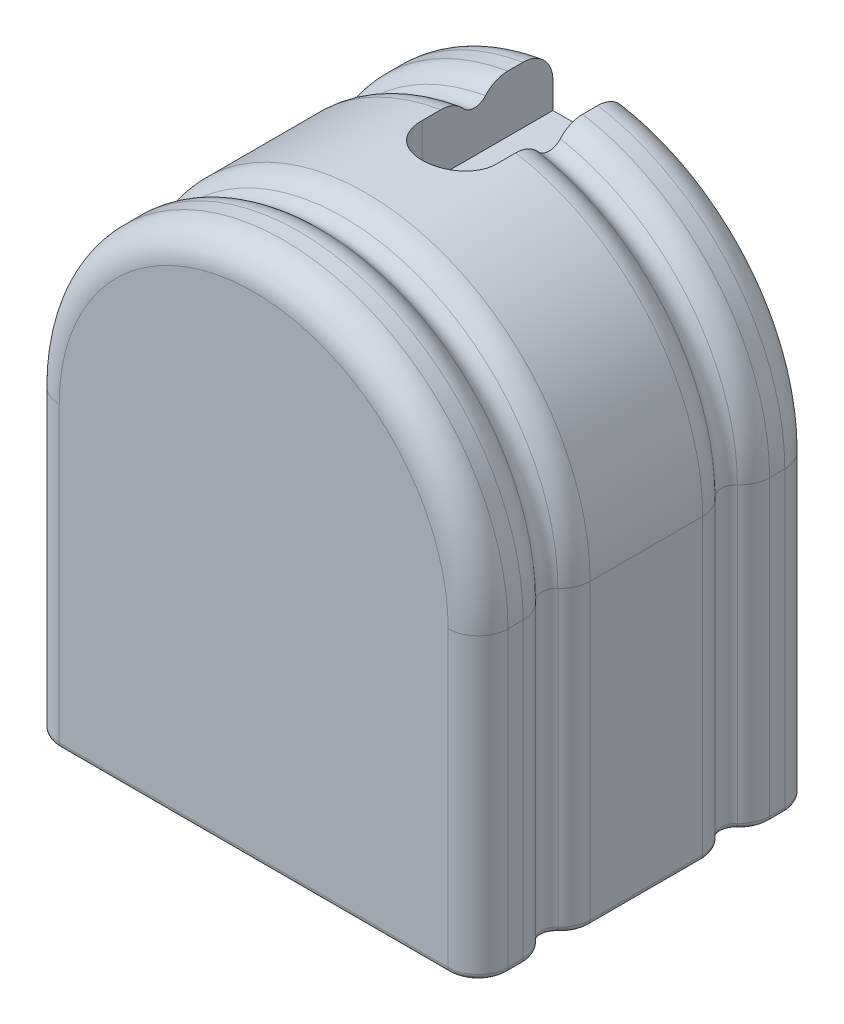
ISO-10303-21;
HEADER;
FILE_DESCRIPTION(('STEP AP214'),'2;1');
FILE_NAME('part.step','',(''),(''),'','','');
FILE_SCHEMA(('AUTOMOTIVE_DESIGN { 1 0 10303 214 1 1 1 1 }'));
ENDSEC;
DATA;
#1=APPLICATION_CONTEXT('core data for automotive mechanical design processes');
#2=APPLICATION_PROTOCOL_DEFINITION('international standard','automotive_design',2000,#1);
#3=PRODUCT_CONTEXT('',#1,'mechanical');
#4=PRODUCT('Part','Part','',(#3));
#5=PRODUCT_RELATED_PRODUCT_CATEGORY('part','',(#4));
#6=PRODUCT_DEFINITION_FORMATION('','',#4);
#7=PRODUCT_DEFINITION_CONTEXT('part definition',#1,'design');
#8=PRODUCT_DEFINITION('design','',#6,#7);
#9=PRODUCT_DEFINITION_SHAPE('','',#8);
#10=(LENGTH_UNIT() NAMED_UNIT(*) SI_UNIT(.MILLI.,.METRE.));
#11=(NAMED_UNIT(*) PLANE_ANGLE_UNIT() SI_UNIT($,.RADIAN.));
#12=(NAMED_UNIT(*) SI_UNIT($,.STERADIAN.) SOLID_ANGLE_UNIT());
#13=UNCERTAINTY_MEASURE_WITH_UNIT(LENGTH_MEASURE(1.E-05),#10,'distance_accuracy_value','');
#14=(GEOMETRIC_REPRESENTATION_CONTEXT(3) GLOBAL_UNCERTAINTY_ASSIGNED_CONTEXT((#13)) GLOBAL_UNIT_ASSIGNED_CONTEXT((#10,
#11,#12)) REPRESENTATION_CONTEXT('',''));
#15=CARTESIAN_POINT('',(0.,0.,0.));
#16=DIRECTION('',(0.,0.,1.));
#17=DIRECTION('',(1.,0.,0.));
#18=AXIS2_PLACEMENT_3D('',#15,#16,#17);
#19=CARTESIAN_POINT('',(-9.525,-17.4625,7.14375));
#20=DIRECTION('',(0.,1.,0.));
#21=DIRECTION('',(-1.,0.,0.));
#22=AXIS2_PLACEMENT_3D('',#19,#20,#21);
#23=PLANE('',#22);
#24=CARTESIAN_POINT('',(0.,-17.4625,0.));
#25=DIRECTION('',(0.,-1.,0.));
#26=DIRECTION('',(0.,0.,-1.));
#27=AXIS2_PLACEMENT_3D('',#24,#25,#26);
#28=CIRCLE('',#27,6.985);
#29=CARTESIAN_POINT('',(1.14959555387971,-17.4625,-6.88975));
#30=VERTEX_POINT('',#29);
#31=CARTESIAN_POINT('',(1.14959555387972,-17.4625,6.88975));
#32=VERTEX_POINT('',#31);
#33=EDGE_CURVE('E408',#30,#32,#28,.T.);
#34=ORIENTED_EDGE('',*,*,#33,.F.);
#35=DIRECTION('',(1.,0.,0.));
#36=VECTOR('',#35,1.);
#37=CARTESIAN_POINT('',(8.25499999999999,-17.4625,-6.88975));
#38=LINE('',#37,#36);
#39=CARTESIAN_POINT('',(8.255,-17.4625,-6.88975));
#40=VERTEX_POINT('',#39);
#41=EDGE_CURVE('E626',#30,#40,#38,.T.);
#42=ORIENTED_EDGE('',*,*,#41,.T.);
#43=CARTESIAN_POINT('',(8.255,-17.4625,-5.87375));
#44=DIRECTION('',(0.,1.,0.));
#45=DIRECTION('',(-1.,0.,0.));
#46=AXIS2_PLACEMENT_3D('',#43,#44,#45);
#47=CIRCLE('',#46,1.016);
#48=CARTESIAN_POINT('',(9.271,-17.4625,-5.87375));
#49=VERTEX_POINT('',#48);
#50=EDGE_CURVE('E624',#40,#49,#47,.F.);
#51=ORIENTED_EDGE('',*,*,#50,.T.);
#52=DIRECTION('',(0.,0.,-1.));
#53=VECTOR('',#52,1.);
#54=CARTESIAN_POINT('',(9.271,-17.4625,7.14375));
#55=LINE('',#54,#53);
#56=CARTESIAN_POINT('',(9.27100000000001,-17.4625,-5.22990316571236));
#57=VERTEX_POINT('',#56);
#58=EDGE_CURVE('E622',#49,#57,#55,.F.);
#59=ORIENTED_EDGE('',*,*,#58,.T.);
#60=CARTESIAN_POINT('',(8.25500000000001,-17.4625,-5.22990316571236));
#61=DIRECTION('',(0.,1.,0.));
#62=DIRECTION('',(-1.,0.,0.));
#63=AXIS2_PLACEMENT_3D('',#60,#61,#62);
#64=CIRCLE('',#63,1.016);
#65=CARTESIAN_POINT('',(8.93233333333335,-17.4625,-4.47262147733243));
#66=VERTEX_POINT('',#65);
#67=EDGE_CURVE('E620',#57,#66,#64,.F.);
#68=ORIENTED_EDGE('',*,*,#67,.T.);
#69=CARTESIAN_POINT('',(9.52500000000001,-17.4625,-3.81));
#70=DIRECTION('',(0.,1.,0.));
#71=DIRECTION('',(-1.,0.,0.));
#72=AXIS2_PLACEMENT_3D('',#69,#70,#71);
#73=CIRCLE('',#72,0.889);
#74=CARTESIAN_POINT('',(8.93233333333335,-17.4625,-3.14737852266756));
#75=VERTEX_POINT('',#74);
#76=EDGE_CURVE('E618',#66,#75,#73,.T.);
#77=ORIENTED_EDGE('',*,*,#76,.T.);
#78=CARTESIAN_POINT('',(8.25500000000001,-17.4625,-2.39009683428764));
#79=DIRECTION('',(0.,1.,0.));
#80=DIRECTION('',(-1.,0.,0.));
#81=AXIS2_PLACEMENT_3D('',#78,#79,#80);
#82=CIRCLE('',#81,1.016);
#83=CARTESIAN_POINT('',(9.271,-17.4625,-2.39009683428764));
#84=VERTEX_POINT('',#83);
#85=EDGE_CURVE('E616',#75,#84,#82,.F.);
#86=ORIENTED_EDGE('',*,*,#85,.T.);
#87=DIRECTION('',(0.,0.,-1.));
#88=VECTOR('',#87,1.);
#89=CARTESIAN_POINT('',(9.271,-17.4625,7.14375));
#90=LINE('',#89,#88);
#91=CARTESIAN_POINT('',(9.27100000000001,-17.4625,2.39009683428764));
#92=VERTEX_POINT('',#91);
#93=EDGE_CURVE('E614',#84,#92,#90,.F.);
#94=ORIENTED_EDGE('',*,*,#93,.T.);
#95=CARTESIAN_POINT('',(8.25500000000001,-17.4625,2.39009683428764));
#96=DIRECTION('',(0.,1.,0.));
#97=DIRECTION('',(-1.,0.,0.));
#98=AXIS2_PLACEMENT_3D('',#95,#96,#97);
#99=CIRCLE('',#98,1.016);
#100=CARTESIAN_POINT('',(8.93233333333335,-17.4625,3.14737852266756));
#101=VERTEX_POINT('',#100);
#102=EDGE_CURVE('E612',#92,#101,#99,.F.);
#103=ORIENTED_EDGE('',*,*,#102,.T.);
#104=CARTESIAN_POINT('',(9.52500000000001,-17.4625,3.81));
#105=DIRECTION('',(0.,1.,0.));
#106=DIRECTION('',(-1.,0.,0.));
#107=AXIS2_PLACEMENT_3D('',#104,#105,#106);
#108=CIRCLE('',#107,0.889);
#109=CARTESIAN_POINT('',(8.93233333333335,-17.4625,4.47262147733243));
#110=VERTEX_POINT('',#109);
#111=EDGE_CURVE('E610',#101,#110,#108,.T.);
#112=ORIENTED_EDGE('',*,*,#111,.T.);
#113=CARTESIAN_POINT('',(8.25500000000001,-17.4625,5.22990316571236));
#114=DIRECTION('',(0.,1.,0.));
#115=DIRECTION('',(-1.,0.,0.));
#116=AXIS2_PLACEMENT_3D('',#113,#114,#115);
#117=CIRCLE('',#116,1.016);
#118=CARTESIAN_POINT('',(9.271,-17.4625,5.22990316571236));
#119=VERTEX_POINT('',#118);
#120=EDGE_CURVE('E608',#110,#119,#117,.F.);
#121=ORIENTED_EDGE('',*,*,#120,.T.);
#122=DIRECTION('',(0.,0.,-1.));
#123=VECTOR('',#122,1.);
#124=CARTESIAN_POINT('',(9.271,-17.4625,7.14375));
#125=LINE('',#124,#123);
#126=CARTESIAN_POINT('',(9.271,-17.4625,5.87375));
#127=VERTEX_POINT('',#126);
#128=EDGE_CURVE('E606',#119,#127,#125,.F.);
#129=ORIENTED_EDGE('',*,*,#128,.T.);
#130=CARTESIAN_POINT('',(8.255,-17.4625,5.87375));
#131=DIRECTION('',(0.,1.,0.));
#132=DIRECTION('',(-1.,0.,0.));
#133=AXIS2_PLACEMENT_3D('',#130,#131,#132);
#134=CIRCLE('',#133,1.016);
#135=CARTESIAN_POINT('',(8.255,-17.4625,6.88975));
#136=VERTEX_POINT('',#135);
#137=EDGE_CURVE('E604',#127,#136,#134,.F.);
#138=ORIENTED_EDGE('',*,*,#137,.T.);
#139=DIRECTION('',(1.,0.,0.));
#140=VECTOR('',#139,1.);
#141=CARTESIAN_POINT('',(-9.525,-17.4625,6.88975));
#142=LINE('',#141,#140);
#143=EDGE_CURVE('E602',#136,#32,#142,.F.);
#144=ORIENTED_EDGE('',*,*,#143,.T.);
#145=EDGE_LOOP('',(#34,#42,#51,#59,#68,#77,#86,#94,#103,#112,#121,#129,#138,#144));
#146=FACE_BOUND('',#145,.T.);
#147=ADVANCED_FACE('F61',(#146),#23,.F.);
#148=CARTESIAN_POINT('',(0.,-4.7625,7.14375));
#149=DIRECTION('',(0.,0.,-1.));
#150=DIRECTION('',(-1.,0.,0.));
#151=AXIS2_PLACEMENT_3D('',#148,#149,#150);
#152=CYLINDRICAL_SURFACE('',#151,9.525);
#153=DIRECTION('',(0.,0.,-1.));
#154=VECTOR('',#153,1.);
#155=CARTESIAN_POINT('',(9.525,-4.7625,7.14375));
#156=LINE('',#155,#154);
#157=CARTESIAN_POINT('',(9.525,-4.7625,2.39009683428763));
#158=VERTEX_POINT('',#157);
#159=CARTESIAN_POINT('',(9.525,-4.7625,-2.39009683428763));
#160=VERTEX_POINT('',#159);
#161=EDGE_CURVE('E432',#158,#160,#156,.T.);
#162=ORIENTED_EDGE('',*,*,#161,.T.);
#163=CARTESIAN_POINT('',(0.,-4.7625,-2.39009683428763));
#164=DIRECTION('',(0.,0.,1.));
#165=DIRECTION('',(1.,0.,0.));
#166=AXIS2_PLACEMENT_3D('',#163,#164,#165);
#167=CIRCLE('',#166,9.525);
#168=CARTESIAN_POINT('',(1.5875,4.62927665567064,-2.39009683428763));
#169=VERTEX_POINT('',#168);
#170=EDGE_CURVE('E995',#160,#169,#167,.T.);
#171=ORIENTED_EDGE('',*,*,#170,.T.);
#172=DIRECTION('',(0.,0.,-1.));
#173=VECTOR('',#172,1.);
#174=CARTESIAN_POINT('',(1.5875,4.62927665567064,7.14375));
#175=LINE('',#174,#173);
#176=CARTESIAN_POINT('',(1.5875,4.62927665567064,-1.5875));
#177=VERTEX_POINT('',#176);
#178=EDGE_CURVE('E402',#169,#177,#175,.F.);
#179=ORIENTED_EDGE('',*,*,#178,.T.);
#180=CARTESIAN_POINT('',(1.5875,4.62927665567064,-1.5875));
#181=CARTESIAN_POINT('',(1.58750007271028,4.62927480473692,-1.54316657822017));
#182=CARTESIAN_POINT('',(1.58564170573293,4.62959096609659,-1.49885470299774));
#183=CARTESIAN_POINT('',(1.5782303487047,4.63083992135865,-1.41055421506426));
#184=CARTESIAN_POINT('',(1.5726777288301,4.63177265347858,-1.3665655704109));
#185=CARTESIAN_POINT('',(1.55054409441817,4.63546125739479,-1.23568517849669));
#186=CARTESIAN_POINT('',(1.52848707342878,4.63910770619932,-1.14967981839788));
#187=CARTESIAN_POINT('',(1.47042628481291,4.64836205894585,-0.982658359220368));
#188=CARTESIAN_POINT('',(1.43441922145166,4.65397042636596,-0.90164344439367));
#189=CARTESIAN_POINT('',(1.34950093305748,4.66651414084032,-0.746787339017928));
#190=CARTESIAN_POINT('',(1.30058921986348,4.67344953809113,-0.672946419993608));
#191=CARTESIAN_POINT('',(1.19074779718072,4.68794079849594,-0.533839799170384));
#192=CARTESIAN_POINT('',(1.12971744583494,4.69550152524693,-0.468654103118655));
#193=CARTESIAN_POINT('',(0.997575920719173,4.71034956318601,-0.349388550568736));
#194=CARTESIAN_POINT('',(0.926462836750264,4.71763682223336,-0.29531080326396));
#195=CARTESIAN_POINT('',(0.775646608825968,4.73116942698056,-0.199493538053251));
#196=CARTESIAN_POINT('',(0.695892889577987,4.73740802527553,-0.157832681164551));
#197=CARTESIAN_POINT('',(0.53041561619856,4.74808032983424,-0.088551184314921));
#198=CARTESIAN_POINT('',(0.44469607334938,4.75251523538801,-0.0609212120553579));
#199=CARTESIAN_POINT('',(0.298731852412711,4.75799485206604,-0.0272013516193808));
#200=CARTESIAN_POINT('',(0.23942581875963,4.75967552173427,-0.017011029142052));
#201=CARTESIAN_POINT('',(0.120088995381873,4.76193176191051,-0.00340911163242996));
#202=CARTESIAN_POINT('',(0.0600590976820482,4.76250857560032,1.01092834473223E-05));
#203=CARTESIAN_POINT('',(0.,4.7625,0.));
#204=B_SPLINE_CURVE_WITH_KNOTS('',3,(#180,#181,#182,#183,#184,#185,#186,#187,#188,#189,#190,
#191,#192,#193,#194,#195,#196,#197,#198,#199,#200,#201,#202,#203),.UNSPECIFIED.,.F.,.F.,(4,2,2,
2,2,2,2,2,2,2,2,4),(0.,0.13291758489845,0.265821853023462,0.531040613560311,0.796322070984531,
1.06161356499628,1.32920804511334,1.59685328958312,1.86615968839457,2.13528672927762,
2.31551114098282,2.495532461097),.UNSPECIFIED.);
#205=CARTESIAN_POINT('',(0.,4.7625,0.));
#206=VERTEX_POINT('',#205);
#207=EDGE_CURVE('E71',#177,#206,#204,.T.);
#208=ORIENTED_EDGE('',*,*,#207,.T.);
#209=CARTESIAN_POINT('',(0.,4.7625,0.));
#210=CARTESIAN_POINT('',(-0.0443377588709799,4.76250171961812,6.0978491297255E-08));
#211=CARTESIAN_POINT('',(-0.0886539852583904,4.76219003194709,-0.00185865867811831));
#212=CARTESIAN_POINT('',(-0.176963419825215,4.76095810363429,-0.00927149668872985));
#213=CARTESIAN_POINT('',(-0.220956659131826,4.76003792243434,-0.0148252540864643));
#214=CARTESIAN_POINT('',(-0.351852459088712,4.75639728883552,-0.036963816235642));
#215=CARTESIAN_POINT('',(-0.437868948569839,4.75279658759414,-0.059026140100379));
#216=CARTESIAN_POINT('',(-0.604913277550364,4.7436414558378,-0.11710236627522));
#217=CARTESIAN_POINT('',(-0.685939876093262,4.73808654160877,-0.153119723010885));
#218=CARTESIAN_POINT('',(-0.840815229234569,4.72563429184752,-0.238062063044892));
#219=CARTESIAN_POINT('',(-0.9146637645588,4.71873691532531,-0.286987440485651));
#220=CARTESIAN_POINT('',(-1.05376157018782,4.70429206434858,-0.396842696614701));
#221=CARTESIAN_POINT('',(-1.11893323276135,4.69673960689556,-0.457870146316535));
#222=CARTESIAN_POINT('',(-1.23817177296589,4.6818726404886,-0.590000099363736));
#223=CARTESIAN_POINT('',(-1.29223647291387,4.6745581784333,-0.661104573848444));
#224=CARTESIAN_POINT('',(-1.38803994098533,4.66094601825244,-0.811913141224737));
#225=CARTESIAN_POINT('',(-1.42969769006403,4.65465512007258,-0.891669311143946));
#226=CARTESIAN_POINT('',(-1.49897261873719,4.64387776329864,-1.05715156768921));
#227=CARTESIAN_POINT('',(-1.52659922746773,4.63939009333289,-1.14287360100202));
#228=CARTESIAN_POINT('',(-1.56030968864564,4.63384222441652,-1.28882855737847));
#229=CARTESIAN_POINT('',(-1.57049577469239,4.63213943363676,-1.34812205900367));
#230=CARTESIAN_POINT('',(-1.58409222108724,4.62985273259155,-1.4674345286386));
#231=CARTESIAN_POINT('',(-1.58751013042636,4.62926757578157,-1.52745261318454));
#232=CARTESIAN_POINT('',(-1.5875,4.62927665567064,-1.5875));
#233=B_SPLINE_CURVE_WITH_KNOTS('',3,(#209,#210,#211,#212,#213,#214,#215,#216,#217,#218,#219,
#220,#221,#222,#223,#224,#225,#226,#227,#228,#229,#230,#231,#232),.UNSPECIFIED.,.F.,.F.,(4,2,2,
2,2,2,2,2,2,2,2,4),(0.,0.132930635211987,0.265848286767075,0.531097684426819,0.796412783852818,
1.06173598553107,1.32929230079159,1.59690102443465,1.86622077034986,2.13535928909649,
2.31554637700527,2.49553237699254),.UNSPECIFIED.);
#234=CARTESIAN_POINT('',(-1.5875,4.62927665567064,-1.5875));
#235=VERTEX_POINT('',#234);
#236=EDGE_CURVE('E12',#206,#235,#233,.T.);
#237=ORIENTED_EDGE('',*,*,#236,.T.);
#238=DIRECTION('',(0.,0.,-1.));
#239=VECTOR('',#238,1.);
#240=CARTESIAN_POINT('',(-1.5875,4.62927665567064,7.14375));
#241=LINE('',#240,#239);
#242=CARTESIAN_POINT('',(-1.5875,4.62927665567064,-2.39009683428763));
#243=VERTEX_POINT('',#242);
#244=EDGE_CURVE('E396',#235,#243,#241,.T.);
#245=ORIENTED_EDGE('',*,*,#244,.T.);
#246=CARTESIAN_POINT('',(0.,-4.7625,-2.39009683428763));
#247=DIRECTION('',(0.,0.,1.));
#248=DIRECTION('',(1.,0.,0.));
#249=AXIS2_PLACEMENT_3D('',#246,#247,#248);
#250=CIRCLE('',#249,9.525);
#251=CARTESIAN_POINT('',(-9.525,-4.7625,-2.39009683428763));
#252=VERTEX_POINT('',#251);
#253=EDGE_CURVE('E989',#243,#252,#250,.T.);
#254=ORIENTED_EDGE('',*,*,#253,.T.);
#255=DIRECTION('',(0.,0.,-1.));
#256=VECTOR('',#255,1.);
#257=CARTESIAN_POINT('',(-9.525,-4.7625,7.14375));
#258=LINE('',#257,#256);
#259=CARTESIAN_POINT('',(-9.525,-4.7625,2.39009683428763));
#260=VERTEX_POINT('',#259);
#261=EDGE_CURVE('E434',#260,#252,#258,.T.);
#262=ORIENTED_EDGE('',*,*,#261,.F.);
#263=CARTESIAN_POINT('',(0.,-4.7625,2.39009683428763));
#264=DIRECTION('',(0.,0.,-1.));
#265=DIRECTION('',(-1.,0.,0.));
#266=AXIS2_PLACEMENT_3D('',#263,#264,#265);
#267=CIRCLE('',#266,9.525);
#268=EDGE_CURVE('E992',#260,#158,#267,.T.);
#269=ORIENTED_EDGE('',*,*,#268,.T.);
#270=EDGE_LOOP('',(#162,#171,#179,#208,#237,#245,#254,#262,#269));
#271=FACE_BOUND('',#270,.T.);
#272=ADVANCED_FACE('F691',(#271),#152,.T.);
#273=CARTESIAN_POINT('',(9.525,-4.7625,5.87375));
#274=VERTEX_POINT('',#273);
#275=CARTESIAN_POINT('',(9.525,-4.7625,5.22990316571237));
#276=VERTEX_POINT('',#275);
#277=EDGE_CURVE('E433',#274,#276,#156,.T.);
#278=ORIENTED_EDGE('',*,*,#277,.T.);
#279=CARTESIAN_POINT('',(0.,-4.7625,5.22990316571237));
#280=DIRECTION('',(0.,0.,1.));
#281=DIRECTION('',(1.,0.,0.));
#282=AXIS2_PLACEMENT_3D('',#279,#280,#281);
#283=CIRCLE('',#282,9.525);
#284=CARTESIAN_POINT('',(-9.525,-4.7625,5.22990316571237));
#285=VERTEX_POINT('',#284);
#286=EDGE_CURVE('E531',#276,#285,#283,.T.);
#287=ORIENTED_EDGE('',*,*,#286,.T.);
#288=CARTESIAN_POINT('',(-9.525,-4.7625,5.87375));
#289=VERTEX_POINT('',#288);
#290=EDGE_CURVE('E437',#289,#285,#258,.T.);
#291=ORIENTED_EDGE('',*,*,#290,.F.);
#292=CARTESIAN_POINT('',(0.,-4.7625,5.87375));
#293=DIRECTION('',(0.,0.,-1.));
#294=DIRECTION('',(-1.,0.,0.));
#295=AXIS2_PLACEMENT_3D('',#292,#293,#294);
#296=CIRCLE('',#295,9.525);
#297=EDGE_CURVE('E529',#289,#274,#296,.T.);
#298=ORIENTED_EDGE('',*,*,#297,.T.);
#299=EDGE_LOOP('',(#278,#287,#291,#298));
#300=FACE_BOUND('',#299,.T.);
#301=ADVANCED_FACE('F698',(#300),#152,.T.);
#302=CARTESIAN_POINT('',(-9.525,-4.7625,7.14375));
#303=DIRECTION('',(1.,0.,0.));
#304=DIRECTION('',(0.,0.,-1.));
#305=AXIS2_PLACEMENT_3D('',#302,#303,#304);
#306=PLANE('',#305);
#307=DIRECTION('',(0.,-1.,0.));
#308=VECTOR('',#307,1.);
#309=CARTESIAN_POINT('',(-9.525,-17.4625,-2.39009683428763));
#310=LINE('',#309,#308);
#311=CARTESIAN_POINT('',(-9.525,-17.2085,-2.39009683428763));
#312=VERTEX_POINT('',#311);
#313=EDGE_CURVE('E961',#252,#312,#310,.T.);
#314=ORIENTED_EDGE('',*,*,#313,.T.);
#315=DIRECTION('',(0.,0.,-1.));
#316=VECTOR('',#315,1.);
#317=CARTESIAN_POINT('',(-9.525,-17.2085,7.14375));
#318=LINE('',#317,#316);
#319=CARTESIAN_POINT('',(-9.525,-17.2085,2.39009683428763));
#320=VERTEX_POINT('',#319);
#321=EDGE_CURVE('E1073',#312,#320,#318,.F.);
#322=ORIENTED_EDGE('',*,*,#321,.T.);
#323=DIRECTION('',(0.,-1.,0.));
#324=VECTOR('',#323,1.);
#325=CARTESIAN_POINT('',(-9.525,-4.7625,2.39009683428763));
#326=LINE('',#325,#324);
#327=EDGE_CURVE('E964',#320,#260,#326,.F.);
#328=ORIENTED_EDGE('',*,*,#327,.T.);
#329=ORIENTED_EDGE('',*,*,#261,.T.);
#330=EDGE_LOOP('',(#314,#322,#328,#329));
#331=FACE_BOUND('',#330,.T.);
#332=ADVANCED_FACE('F1236',(#331),#306,.F.);
#333=DIRECTION('',(0.,-1.,0.));
#334=VECTOR('',#333,1.);
#335=CARTESIAN_POINT('',(-9.525,-17.4625,5.22990316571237));
#336=LINE('',#335,#334);
#337=CARTESIAN_POINT('',(-9.525,-17.2085,5.22990316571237));
#338=VERTEX_POINT('',#337);
#339=EDGE_CURVE('E948',#285,#338,#336,.T.);
#340=ORIENTED_EDGE('',*,*,#339,.T.);
#341=DIRECTION('',(0.,0.,-1.));
#342=VECTOR('',#341,1.);
#343=CARTESIAN_POINT('',(-9.525,-17.2085,7.14375));
#344=LINE('',#343,#342);
#345=CARTESIAN_POINT('',(-9.525,-17.2085,5.87375));
#346=VERTEX_POINT('',#345);
#347=EDGE_CURVE('E628',#338,#346,#344,.F.);
#348=ORIENTED_EDGE('',*,*,#347,.T.);
#349=DIRECTION('',(0.,-1.,0.));
#350=VECTOR('',#349,1.);
#351=CARTESIAN_POINT('',(-9.525,-4.7625,5.87375));
#352=LINE('',#351,#350);
#353=EDGE_CURVE('E946',#346,#289,#352,.F.);
#354=ORIENTED_EDGE('',*,*,#353,.T.);
#355=ORIENTED_EDGE('',*,*,#290,.T.);
#356=EDGE_LOOP('',(#340,#348,#354,#355));
#357=FACE_BOUND('',#356,.T.);
#358=ADVANCED_FACE('F1136',(#357),#306,.F.);
#359=CARTESIAN_POINT('',(9.525,-4.7625,7.14375));
#360=DIRECTION('',(-1.,0.,0.));
#361=DIRECTION('',(0.,0.,1.));
#362=AXIS2_PLACEMENT_3D('',#359,#360,#361);
#363=PLANE('',#362);
#364=DIRECTION('',(0.,1.,0.));
#365=VECTOR('',#364,1.);
#366=CARTESIAN_POINT('',(9.525,-17.4625,2.39009683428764));
#367=LINE('',#366,#365);
#368=CARTESIAN_POINT('',(9.525,-17.2085,2.39009683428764));
#369=VERTEX_POINT('',#368);
#370=EDGE_CURVE('E936',#158,#369,#367,.F.);
#371=ORIENTED_EDGE('',*,*,#370,.T.);
#372=DIRECTION('',(0.,0.,-1.));
#373=VECTOR('',#372,1.);
#374=CARTESIAN_POINT('',(9.525,-17.2085,7.14375));
#375=LINE('',#374,#373);
#376=CARTESIAN_POINT('',(9.525,-17.2085,-2.39009683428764));
#377=VERTEX_POINT('',#376);
#378=EDGE_CURVE('E1057',#369,#377,#375,.T.);
#379=ORIENTED_EDGE('',*,*,#378,.T.);
#380=DIRECTION('',(0.,1.,0.));
#381=VECTOR('',#380,1.);
#382=CARTESIAN_POINT('',(9.525,-4.7625,-2.39009683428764));
#383=LINE('',#382,#381);
#384=EDGE_CURVE('E939',#377,#160,#383,.T.);
#385=ORIENTED_EDGE('',*,*,#384,.T.);
#386=ORIENTED_EDGE('',*,*,#161,.F.);
#387=EDGE_LOOP('',(#371,#379,#385,#386));
#388=FACE_BOUND('',#387,.T.);
#389=ADVANCED_FACE('F716',(#388),#363,.F.);
#390=DIRECTION('',(0.,1.,0.));
#391=VECTOR('',#390,1.);
#392=CARTESIAN_POINT('',(9.525,-4.7625,5.87375));
#393=LINE('',#392,#391);
#394=CARTESIAN_POINT('',(9.525,-17.2085,5.87375));
#395=VERTEX_POINT('',#394);
#396=EDGE_CURVE('E956',#274,#395,#393,.F.);
#397=ORIENTED_EDGE('',*,*,#396,.T.);
#398=DIRECTION('',(0.,0.,-1.));
#399=VECTOR('',#398,1.);
#400=CARTESIAN_POINT('',(9.525,-17.2085,7.14375));
#401=LINE('',#400,#399);
#402=CARTESIAN_POINT('',(9.525,-17.2085,5.22990316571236));
#403=VERTEX_POINT('',#402);
#404=EDGE_CURVE('E635',#395,#403,#401,.T.);
#405=ORIENTED_EDGE('',*,*,#404,.T.);
#406=DIRECTION('',(0.,1.,0.));
#407=VECTOR('',#406,1.);
#408=CARTESIAN_POINT('',(9.525,-4.7625,5.22990316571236));
#409=LINE('',#408,#407);
#410=EDGE_CURVE('E959',#403,#276,#409,.T.);
#411=ORIENTED_EDGE('',*,*,#410,.T.);
#412=ORIENTED_EDGE('',*,*,#277,.F.);
#413=EDGE_LOOP('',(#397,#405,#411,#412));
#414=FACE_BOUND('',#413,.T.);
#415=ADVANCED_FACE('F717',(#414),#363,.F.);
#416=DIRECTION('',(0.,0.,-1.));
#417=VECTOR('',#416,1.);
#418=CARTESIAN_POINT('',(1.5875,4.62927665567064,7.14375));
#419=LINE('',#418,#417);
#420=CARTESIAN_POINT('',(1.5875,4.62927665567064,-5.87375));
#421=VERTEX_POINT('',#420);
#422=CARTESIAN_POINT('',(1.5875,4.62927665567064,-5.22990316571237));
#423=VERTEX_POINT('',#422);
#424=EDGE_CURVE('E404',#421,#423,#419,.F.);
#425=ORIENTED_EDGE('',*,*,#424,.T.);
#426=CARTESIAN_POINT('',(0.,-4.7625,-5.22990316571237));
#427=DIRECTION('',(0.,0.,-1.));
#428=DIRECTION('',(-1.,0.,0.));
#429=AXIS2_PLACEMENT_3D('',#426,#427,#428);
#430=CIRCLE('',#429,9.525);
#431=CARTESIAN_POINT('',(9.525,-4.7625,-5.22990316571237));
#432=VERTEX_POINT('',#431);
#433=EDGE_CURVE('E535',#423,#432,#430,.T.);
#434=ORIENTED_EDGE('',*,*,#433,.T.);
#435=CARTESIAN_POINT('',(9.525,-4.7625,-5.87375));
#436=VERTEX_POINT('',#435);
#437=EDGE_CURVE('E427',#432,#436,#156,.T.);
#438=ORIENTED_EDGE('',*,*,#437,.T.);
#439=CARTESIAN_POINT('',(0.,-4.7625,-5.87375));
#440=DIRECTION('',(0.,0.,-1.));
#441=DIRECTION('',(-1.,0.,0.));
#442=AXIS2_PLACEMENT_3D('',#439,#440,#441);
#443=CIRCLE('',#442,9.525);
#444=EDGE_CURVE('E533',#436,#421,#443,.F.);
#445=ORIENTED_EDGE('',*,*,#444,.T.);
#446=EDGE_LOOP('',(#425,#434,#438,#445));
#447=FACE_BOUND('',#446,.T.);
#448=ADVANCED_FACE('F1172',(#447),#152,.T.);
#449=CARTESIAN_POINT('',(0.,-4.7625,-3.81));
#450=DIRECTION('',(0.,0.,-1.));
#451=DIRECTION('',(-1.,0.,0.));
#452=AXIS2_PLACEMENT_3D('',#449,#450,#451);
#453=TOROIDAL_SURFACE('',#452,9.525,0.635);
#454=CARTESIAN_POINT('',(1.5875,4.07206529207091,-4.12920644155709));
#455=CARTESIAN_POINT('',(1.5875,4.09036349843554,-4.16017433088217));
#456=CARTESIAN_POINT('',(1.5875,4.11132249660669,-4.1896032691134));
#457=CARTESIAN_POINT('',(1.5875,4.15791989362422,-4.24453290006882));
#458=CARTESIAN_POINT('',(1.5875,4.18356472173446,-4.27002810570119));
#459=CARTESIAN_POINT('',(1.5875,4.23872862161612,-4.31634330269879));
#460=CARTESIAN_POINT('',(1.5875,4.26824332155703,-4.33716849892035));
#461=CARTESIAN_POINT('',(1.5875,4.33030975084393,-4.37362366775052));
#462=CARTESIAN_POINT('',(1.5875,4.36286072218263,-4.38925493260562));
#463=CARTESIAN_POINT('',(1.5875,4.43045949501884,-4.41506719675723));
#464=CARTESIAN_POINT('',(1.5875,4.4655304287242,-4.42518762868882));
#465=CARTESIAN_POINT('',(1.5875,4.53686933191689,-4.43945387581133));
#466=CARTESIAN_POINT('',(1.5875,4.57313742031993,-4.44359909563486));
#467=CARTESIAN_POINT('',(1.5875,4.64617076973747,-4.44581131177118));
#468=CARTESIAN_POINT('',(1.5875,4.68293762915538,-4.44382597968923));
#469=CARTESIAN_POINT('',(1.5875,4.75561655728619,-4.43370787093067));
#470=CARTESIAN_POINT('',(1.5875,4.79152861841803,-4.42557503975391));
#471=CARTESIAN_POINT('',(1.5875,4.86144625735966,-4.40337760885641));
#472=CARTESIAN_POINT('',(1.5875,4.89545305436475,-4.38931685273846));
#473=CARTESIAN_POINT('',(1.5875,4.96059382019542,-4.35563671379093));
#474=CARTESIAN_POINT('',(1.5875,4.99172790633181,-4.33601755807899));
#475=CARTESIAN_POINT('',(1.5875,5.04994015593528,-4.29195211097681));
#476=CARTESIAN_POINT('',(1.5875,5.07705147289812,-4.26754962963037));
#477=CARTESIAN_POINT('',(1.5875,5.1267278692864,-4.21448745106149));
#478=CARTESIAN_POINT('',(1.5875,5.14929325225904,-4.18582803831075));
#479=CARTESIAN_POINT('',(1.5875,5.18893469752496,-4.12545265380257));
#480=CARTESIAN_POINT('',(1.5875,5.20607631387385,-4.0937797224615));
#481=CARTESIAN_POINT('',(1.5875,5.2347295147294,-4.02798204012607));
#482=CARTESIAN_POINT('',(1.5875,5.2462414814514,-3.99385745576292));
#483=CARTESIAN_POINT('',(1.5875,5.26318409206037,-3.92453514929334));
#484=CARTESIAN_POINT('',(1.5875,5.26868116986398,-3.88935365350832));
#485=CARTESIAN_POINT('',(1.5875,5.27365427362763,-3.81856816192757));
#486=CARTESIAN_POINT('',(1.5875,5.27313054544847,-3.78296418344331));
#487=CARTESIAN_POINT('',(1.5875,5.26609830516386,-3.71255307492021));
#488=CARTESIAN_POINT('',(1.5875,5.25962301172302,-3.67774261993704));
#489=CARTESIAN_POINT('',(1.5875,5.24093085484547,-3.60969995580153));
#490=CARTESIAN_POINT('',(1.5875,5.2287140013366,-3.57646774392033));
#491=CARTESIAN_POINT('',(1.5875,5.19887534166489,-3.51244816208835));
#492=CARTESIAN_POINT('',(1.5875,5.18124307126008,-3.48166567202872));
#493=CARTESIAN_POINT('',(1.5875,5.14110294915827,-3.42346452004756));
#494=CARTESIAN_POINT('',(1.5875,5.11859491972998,-3.39604598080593));
#495=CARTESIAN_POINT('',(1.5875,5.06914040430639,-3.34508952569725));
#496=CARTESIAN_POINT('',(1.5875,5.04215704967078,-3.3215874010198));
#497=CARTESIAN_POINT('',(1.5875,4.98466886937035,-3.27938088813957));
#498=CARTESIAN_POINT('',(1.5875,4.95416382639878,-3.26067679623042));
#499=CARTESIAN_POINT('',(1.5875,4.89009557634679,-3.22835135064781));
#500=CARTESIAN_POINT('',(1.5875,4.8564992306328,-3.21479567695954));
#501=CARTESIAN_POINT('',(1.5875,4.78752339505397,-3.19344524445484));
#502=CARTESIAN_POINT('',(1.5875,4.75214378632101,-3.185650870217));
#503=CARTESIAN_POINT('',(1.5875,4.68017430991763,-3.17596237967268));
#504=CARTESIAN_POINT('',(1.5875,4.64357524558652,-3.17413650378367));
#505=CARTESIAN_POINT('',(1.5875,4.57058489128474,-3.17661800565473));
#506=CARTESIAN_POINT('',(1.5875,4.53419361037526,-3.18092564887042));
#507=CARTESIAN_POINT('',(1.5875,4.46244228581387,-3.19559895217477));
#508=CARTESIAN_POINT('',(1.5875,4.42708905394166,-3.20599796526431));
#509=CARTESIAN_POINT('',(1.5875,4.35863846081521,-3.23260385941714));
#510=CARTESIAN_POINT('',(1.5875,4.32554109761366,-3.24881073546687));
#511=CARTESIAN_POINT('',(1.5875,4.26268041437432,-3.28653005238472));
#512=CARTESIAN_POINT('',(1.5875,4.23290564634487,-3.30802340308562));
#513=CARTESIAN_POINT('',(1.5875,4.17744252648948,-3.35576000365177));
#514=CARTESIAN_POINT('',(1.5875,4.15175394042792,-3.38200298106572));
#515=CARTESIAN_POINT('',(1.5875,4.10553212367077,-3.43816341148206));
#516=CARTESIAN_POINT('',(1.5875,4.08494063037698,-3.46803289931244));
#517=CARTESIAN_POINT('',(1.5875,4.04915680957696,-3.53084658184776));
#518=CARTESIAN_POINT('',(1.5875,4.03396377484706,-3.56379037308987));
#519=CARTESIAN_POINT('',(1.5875,4.00964841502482,-3.63127355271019));
#520=CARTESIAN_POINT('',(1.5875,4.0004363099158,-3.66578060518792));
#521=CARTESIAN_POINT('',(1.5875,3.9880049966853,-3.73586733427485));
#522=CARTESIAN_POINT('',(1.5875,3.98478688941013,-3.77144720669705));
#523=CARTESIAN_POINT('',(1.5875,3.98445007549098,-3.84226422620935));
#524=CARTESIAN_POINT('',(1.5875,3.98726890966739,-3.8775011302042));
#525=CARTESIAN_POINT('',(1.5875,3.99879039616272,-3.94696782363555));
#526=CARTESIAN_POINT('',(1.5875,4.00748565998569,-3.98119882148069));
#527=CARTESIAN_POINT('',(1.5875,4.02586631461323,-4.03439722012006));
#528=CARTESIAN_POINT('',(1.5875,4.03376861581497,-4.05399950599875));
#529=CARTESIAN_POINT('',(1.5875,4.05149667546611,-4.09231348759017));
#530=CARTESIAN_POINT('',(1.5875,4.06132241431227,-4.11102519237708));
#531=CARTESIAN_POINT('',(1.5875,4.07206529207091,-4.12920644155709));
#532=B_SPLINE_CURVE_WITH_KNOTS('',3,(#454,#455,#456,#457,#458,#459,#460,#461,#462,#463,#464,
#465,#466,#467,#468,#469,#470,#471,#472,#473,#474,#475,#476,#477,#478,#479,#480,#481,#482,#483,
#484,#485,#486,#487,#488,#489,#490,#491,#492,#493,#494,#495,#496,#497,#498,#499,#500,#501,#502,
#503,#504,#505,#506,#507,#508,#509,#510,#511,#512,#513,#514,#515,#516,#517,#518,#519,#520,#521,
#522,#523,#524,#525,#526,#527,#528,#529,#530,#531),.UNSPECIFIED.,.T.,.F.,(4,2,2,2,2,2,2,2,2,2,2,
2,2,2,2,2,2,2,2,2,2,2,2,2,2,2,2,2,2,2,2,2,2,2,2,2,2,2,4),(0.,0.107831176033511,
0.215811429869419,0.323670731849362,0.431503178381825,0.540498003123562,0.649503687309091,
0.75944237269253,0.869382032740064,0.979250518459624,1.08911451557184,1.19801570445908,
1.3069096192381,1.4144321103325,1.52194730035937,1.62826261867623,1.73457359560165,
1.84029477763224,1.94601577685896,2.05194236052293,2.15787280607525,2.26472373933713,
2.37158126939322,2.47975955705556,2.5879450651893,2.69736325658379,2.80678618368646,
2.9168139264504,3.02684157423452,3.13647758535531,3.24610730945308,3.35441912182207,
3.46271673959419,3.56934861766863,3.67600007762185,3.78155343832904,3.88697433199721,
3.95028266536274,4.01359035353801),.UNSPECIFIED.);
#533=CARTESIAN_POINT('',(1.5875,4.19965263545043,-3.33669894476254));
#534=VERTEX_POINT('',#533);
#535=CARTESIAN_POINT('',(1.5875,4.19965263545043,-4.28330105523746));
#536=VERTEX_POINT('',#535);
#537=EDGE_CURVE('E447',#534,#536,#532,.T.);
#538=ORIENTED_EDGE('',*,*,#537,.F.);
#539=CARTESIAN_POINT('',(0.,-4.7625,-3.33669894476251));
#540=DIRECTION('',(0.,0.,-1.));
#541=DIRECTION('',(-1.,0.,0.));
#542=AXIS2_PLACEMENT_3D('',#539,#540,#541);
#543=CIRCLE('',#542,9.10166666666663);
#544=CARTESIAN_POINT('',(9.10166666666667,-4.7625,-3.33669894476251));
#545=VERTEX_POINT('',#544);
#546=EDGE_CURVE('E993',#534,#545,#543,.T.);
#547=ORIENTED_EDGE('',*,*,#546,.T.);
#548=CARTESIAN_POINT('',(9.525,-4.7625,-3.81));
#549=DIRECTION('',(0.,1.,0.));
#550=DIRECTION('',(-1.,0.,0.));
#551=AXIS2_PLACEMENT_3D('',#548,#549,#550);
#552=CIRCLE('',#551,0.635);
#553=CARTESIAN_POINT('',(9.10166666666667,-4.7625,-4.28330105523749));
#554=VERTEX_POINT('',#553);
#555=EDGE_CURVE('E424',#554,#545,#552,.T.);
#556=ORIENTED_EDGE('',*,*,#555,.F.);
#557=CARTESIAN_POINT('',(0.,-4.7625,-4.28330105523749));
#558=DIRECTION('',(0.,0.,1.));
#559=DIRECTION('',(1.,0.,0.));
#560=AXIS2_PLACEMENT_3D('',#557,#558,#559);
#561=CIRCLE('',#560,9.10166666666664);
#562=EDGE_CURVE('E997',#554,#536,#561,.T.);
#563=ORIENTED_EDGE('',*,*,#562,.T.);
#564=EDGE_LOOP('',(#538,#547,#556,#563));
#565=FACE_BOUND('',#564,.T.);
#566=ADVANCED_FACE('F1161',(#565),#453,.F.);
#567=DIRECTION('',(0.,0.,-1.));
#568=VECTOR('',#567,1.);
#569=CARTESIAN_POINT('',(-1.5875,4.62927665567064,7.14375));
#570=LINE('',#569,#568);
#571=CARTESIAN_POINT('',(-1.5875,4.62927665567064,-5.22990316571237));
#572=VERTEX_POINT('',#571);
#573=CARTESIAN_POINT('',(-1.5875,4.62927665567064,-5.87375));
#574=VERTEX_POINT('',#573);
#575=EDGE_CURVE('E399',#572,#574,#570,.T.);
#576=ORIENTED_EDGE('',*,*,#575,.T.);
#577=CARTESIAN_POINT('',(0.,-4.7625,-5.87375));
#578=DIRECTION('',(0.,0.,-1.));
#579=DIRECTION('',(-1.,0.,0.));
#580=AXIS2_PLACEMENT_3D('',#577,#578,#579);
#581=CIRCLE('',#580,9.525);
#582=CARTESIAN_POINT('',(-9.525,-4.7625,-5.87375));
#583=VERTEX_POINT('',#582);
#584=EDGE_CURVE('E979',#574,#583,#581,.F.);
#585=ORIENTED_EDGE('',*,*,#584,.T.);
#586=CARTESIAN_POINT('',(-9.525,-4.7625,-5.22990316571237));
#587=VERTEX_POINT('',#586);
#588=EDGE_CURVE('E438',#587,#583,#258,.T.);
#589=ORIENTED_EDGE('',*,*,#588,.F.);
#590=CARTESIAN_POINT('',(0.,-4.7625,-5.22990316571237));
#591=DIRECTION('',(0.,0.,-1.));
#592=DIRECTION('',(-1.,0.,0.));
#593=AXIS2_PLACEMENT_3D('',#590,#591,#592);
#594=CIRCLE('',#593,9.525);
#595=EDGE_CURVE('E978',#587,#572,#594,.T.);
#596=ORIENTED_EDGE('',*,*,#595,.T.);
#597=EDGE_LOOP('',(#576,#585,#589,#596));
#598=FACE_BOUND('',#597,.T.);
#599=ADVANCED_FACE('F700',(#598),#152,.T.);
#600=DIRECTION('',(0.,-1.,0.));
#601=VECTOR('',#600,1.);
#602=CARTESIAN_POINT('',(-9.525,-17.4625,-5.87375));
#603=LINE('',#602,#601);
#604=CARTESIAN_POINT('',(-9.525,-17.2085,-5.87375));
#605=VERTEX_POINT('',#604);
#606=EDGE_CURVE('E911',#583,#605,#603,.T.);
#607=ORIENTED_EDGE('',*,*,#606,.T.);
#608=DIRECTION('',(0.,0.,-1.));
#609=VECTOR('',#608,1.);
#610=CARTESIAN_POINT('',(-9.525,-17.2085,7.14375));
#611=LINE('',#610,#609);
#612=CARTESIAN_POINT('',(-9.525,-17.2085,-5.22990316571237));
#613=VERTEX_POINT('',#612);
#614=EDGE_CURVE('E631',#605,#613,#611,.F.);
#615=ORIENTED_EDGE('',*,*,#614,.T.);
#616=DIRECTION('',(0.,-1.,0.));
#617=VECTOR('',#616,1.);
#618=CARTESIAN_POINT('',(-9.525,-4.7625,-5.22990316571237));
#619=LINE('',#618,#617);
#620=EDGE_CURVE('E908',#613,#587,#619,.F.);
#621=ORIENTED_EDGE('',*,*,#620,.T.);
#622=ORIENTED_EDGE('',*,*,#588,.T.);
#623=EDGE_LOOP('',(#607,#615,#621,#622));
#624=FACE_BOUND('',#623,.T.);
#625=ADVANCED_FACE('F714',(#624),#306,.F.);
#626=DIRECTION('',(0.,1.,0.));
#627=VECTOR('',#626,1.);
#628=CARTESIAN_POINT('',(9.525,-17.4625,-5.22990316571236));
#629=LINE('',#628,#627);
#630=CARTESIAN_POINT('',(9.525,-17.2085,-5.22990316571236));
#631=VERTEX_POINT('',#630);
#632=EDGE_CURVE('E968',#432,#631,#629,.F.);
#633=ORIENTED_EDGE('',*,*,#632,.T.);
#634=DIRECTION('',(0.,0.,-1.));
#635=VECTOR('',#634,1.);
#636=CARTESIAN_POINT('',(9.525,-17.2085,7.14375));
#637=LINE('',#636,#635);
#638=CARTESIAN_POINT('',(9.525,-17.2085,-5.87375));
#639=VERTEX_POINT('',#638);
#640=EDGE_CURVE('E633',#631,#639,#637,.T.);
#641=ORIENTED_EDGE('',*,*,#640,.T.);
#642=DIRECTION('',(0.,1.,0.));
#643=VECTOR('',#642,1.);
#644=CARTESIAN_POINT('',(9.525,-4.7625,-5.87375));
#645=LINE('',#644,#643);
#646=EDGE_CURVE('E966',#639,#436,#645,.T.);
#647=ORIENTED_EDGE('',*,*,#646,.T.);
#648=ORIENTED_EDGE('',*,*,#437,.F.);
#649=EDGE_LOOP('',(#633,#641,#647,#648));
#650=FACE_BOUND('',#649,.T.);
#651=ADVANCED_FACE('F706',(#650),#363,.F.);
#652=CARTESIAN_POINT('',(-8.255,-17.4625,-5.87375));
#653=DIRECTION('',(0.,1.,0.));
#654=DIRECTION('',(-1.,0.,0.));
#655=AXIS2_PLACEMENT_3D('',#652,#653,#654);
#656=CIRCLE('',#655,1.016);
#657=CARTESIAN_POINT('',(-9.271,-17.4625,-5.87375));
#658=VERTEX_POINT('',#657);
#659=CARTESIAN_POINT('',(-8.255,-17.4625,-6.88975));
#660=VERTEX_POINT('',#659);
#661=EDGE_CURVE('E598',#658,#660,#656,.F.);
#662=ORIENTED_EDGE('',*,*,#661,.T.);
#663=DIRECTION('',(1.,0.,0.));
#664=VECTOR('',#663,1.);
#665=CARTESIAN_POINT('',(8.25499999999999,-17.4625,-6.88975));
#666=LINE('',#665,#664);
#667=CARTESIAN_POINT('',(-1.1495955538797,-17.4625,-6.88975));
#668=VERTEX_POINT('',#667);
#669=EDGE_CURVE('E600',#660,#668,#666,.T.);
#670=ORIENTED_EDGE('',*,*,#669,.T.);
#671=CARTESIAN_POINT('',(-1.14959555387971,-17.4625,6.88975));
#672=VERTEX_POINT('',#671);
#673=EDGE_CURVE('E407',#672,#668,#28,.T.);
#674=ORIENTED_EDGE('',*,*,#673,.F.);
#675=DIRECTION('',(1.,0.,0.));
#676=VECTOR('',#675,1.);
#677=CARTESIAN_POINT('',(-9.525,-17.4625,6.88975));
#678=LINE('',#677,#676);
#679=CARTESIAN_POINT('',(-8.255,-17.4625,6.88975));
#680=VERTEX_POINT('',#679);
#681=EDGE_CURVE('E537',#672,#680,#678,.F.);
#682=ORIENTED_EDGE('',*,*,#681,.T.);
#683=CARTESIAN_POINT('',(-8.255,-17.4625,5.87375));
#684=DIRECTION('',(0.,1.,0.));
#685=DIRECTION('',(-1.,0.,0.));
#686=AXIS2_PLACEMENT_3D('',#683,#684,#685);
#687=CIRCLE('',#686,1.016);
#688=CARTESIAN_POINT('',(-9.271,-17.4625,5.87375));
#689=VERTEX_POINT('',#688);
#690=EDGE_CURVE('E577',#680,#689,#687,.F.);
#691=ORIENTED_EDGE('',*,*,#690,.T.);
#692=DIRECTION('',(0.,0.,-1.));
#693=VECTOR('',#692,1.);
#694=CARTESIAN_POINT('',(-9.271,-17.4625,7.14375));
#695=LINE('',#694,#693);
#696=CARTESIAN_POINT('',(-9.271,-17.4625,5.22990316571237));
#697=VERTEX_POINT('',#696);
#698=EDGE_CURVE('E579',#689,#697,#695,.T.);
#699=ORIENTED_EDGE('',*,*,#698,.T.);
#700=CARTESIAN_POINT('',(-8.255,-17.4625,5.22990316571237));
#701=DIRECTION('',(0.,1.,0.));
#702=DIRECTION('',(-1.,0.,0.));
#703=AXIS2_PLACEMENT_3D('',#700,#701,#702);
#704=CIRCLE('',#703,1.016);
#705=CARTESIAN_POINT('',(-8.93233333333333,-17.4625,4.47262147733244));
#706=VERTEX_POINT('',#705);
#707=EDGE_CURVE('E582',#697,#706,#704,.F.);
#708=ORIENTED_EDGE('',*,*,#707,.T.);
#709=CARTESIAN_POINT('',(-9.525,-17.4625,3.81));
#710=DIRECTION('',(0.,1.,0.));
#711=DIRECTION('',(-1.,0.,0.));
#712=AXIS2_PLACEMENT_3D('',#709,#710,#711);
#713=CIRCLE('',#712,0.889);
#714=CARTESIAN_POINT('',(-8.93233333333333,-17.4625,3.14737852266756));
#715=VERTEX_POINT('',#714);
#716=EDGE_CURVE('E584',#706,#715,#713,.T.);
#717=ORIENTED_EDGE('',*,*,#716,.T.);
#718=CARTESIAN_POINT('',(-8.255,-17.4625,2.39009683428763));
#719=DIRECTION('',(0.,1.,0.));
#720=DIRECTION('',(-1.,0.,0.));
#721=AXIS2_PLACEMENT_3D('',#718,#719,#720);
#722=CIRCLE('',#721,1.016);
#723=CARTESIAN_POINT('',(-9.271,-17.4625,2.39009683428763));
#724=VERTEX_POINT('',#723);
#725=EDGE_CURVE('E586',#715,#724,#722,.F.);
#726=ORIENTED_EDGE('',*,*,#725,.T.);
#727=DIRECTION('',(0.,0.,-1.));
#728=VECTOR('',#727,1.);
#729=CARTESIAN_POINT('',(-9.271,-17.4625,7.14375));
#730=LINE('',#729,#728);
#731=CARTESIAN_POINT('',(-9.271,-17.4625,-2.39009683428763));
#732=VERTEX_POINT('',#731);
#733=EDGE_CURVE('E588',#724,#732,#730,.T.);
#734=ORIENTED_EDGE('',*,*,#733,.T.);
#735=CARTESIAN_POINT('',(-8.255,-17.4625,-2.39009683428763));
#736=DIRECTION('',(0.,1.,0.));
#737=DIRECTION('',(-1.,0.,0.));
#738=AXIS2_PLACEMENT_3D('',#735,#736,#737);
#739=CIRCLE('',#738,1.016);
#740=CARTESIAN_POINT('',(-8.93233333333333,-17.4625,-3.14737852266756));
#741=VERTEX_POINT('',#740);
#742=EDGE_CURVE('E590',#732,#741,#739,.F.);
#743=ORIENTED_EDGE('',*,*,#742,.T.);
#744=CARTESIAN_POINT('',(-9.525,-17.4625,-3.81));
#745=DIRECTION('',(0.,1.,0.));
#746=DIRECTION('',(-1.,0.,0.));
#747=AXIS2_PLACEMENT_3D('',#744,#745,#746);
#748=CIRCLE('',#747,0.889);
#749=CARTESIAN_POINT('',(-8.93233333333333,-17.4625,-4.47262147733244));
#750=VERTEX_POINT('',#749);
#751=EDGE_CURVE('E592',#741,#750,#748,.T.);
#752=ORIENTED_EDGE('',*,*,#751,.T.);
#753=CARTESIAN_POINT('',(-8.255,-17.4625,-5.22990316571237));
#754=DIRECTION('',(0.,1.,0.));
#755=DIRECTION('',(-1.,0.,0.));
#756=AXIS2_PLACEMENT_3D('',#753,#754,#755);
#757=CIRCLE('',#756,1.016);
#758=CARTESIAN_POINT('',(-9.271,-17.4625,-5.22990316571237));
#759=VERTEX_POINT('',#758);
#760=EDGE_CURVE('E594',#750,#759,#757,.F.);
#761=ORIENTED_EDGE('',*,*,#760,.T.);
#762=DIRECTION('',(0.,0.,-1.));
#763=VECTOR('',#762,1.);
#764=CARTESIAN_POINT('',(-9.271,-17.4625,7.14375));
#765=LINE('',#764,#763);
#766=EDGE_CURVE('E596',#759,#658,#765,.T.);
#767=ORIENTED_EDGE('',*,*,#766,.T.);
#768=EDGE_LOOP('',(#662,#670,#674,#682,#691,#699,#708,#717,#726,#734,#743,#752,#761,#767));
#769=FACE_BOUND('',#768,.T.);
#770=ADVANCED_FACE('F694',(#769),#23,.F.);
#771=CARTESIAN_POINT('',(0.,-4.7625,7.14375));
#772=DIRECTION('',(0.,0.,-1.));
#773=DIRECTION('',(-1.,0.,0.));
#774=AXIS2_PLACEMENT_3D('',#771,#772,#773);
#775=PLANE('',#774);
#776=DIRECTION('',(0.,-1.,0.));
#777=VECTOR('',#776,1.);
#778=CARTESIAN_POINT('',(-8.255,-4.7625,7.14375));
#779=LINE('',#778,#777);
#780=CARTESIAN_POINT('',(-8.255,-4.7625,7.14375));
#781=VERTEX_POINT('',#780);
#782=CARTESIAN_POINT('',(-8.255,-17.2085,7.14375));
#783=VERTEX_POINT('',#782);
#784=EDGE_CURVE('E973',#781,#783,#779,.T.);
#785=ORIENTED_EDGE('',*,*,#784,.T.);
#786=DIRECTION('',(1.,0.,0.));
#787=VECTOR('',#786,1.);
#788=CARTESIAN_POINT('',(0.,-17.2085,7.14375));
#789=LINE('',#788,#787);
#790=CARTESIAN_POINT('',(8.255,-17.2085,7.14375));
#791=VERTEX_POINT('',#790);
#792=EDGE_CURVE('E761',#783,#791,#789,.T.);
#793=ORIENTED_EDGE('',*,*,#792,.T.);
#794=DIRECTION('',(0.,1.,0.));
#795=VECTOR('',#794,1.);
#796=CARTESIAN_POINT('',(8.255,-4.7625,7.14375));
#797=LINE('',#796,#795);
#798=CARTESIAN_POINT('',(8.255,-4.7625,7.14375));
#799=VERTEX_POINT('',#798);
#800=EDGE_CURVE('E976',#791,#799,#797,.T.);
#801=ORIENTED_EDGE('',*,*,#800,.T.);
#802=CARTESIAN_POINT('',(0.,-4.7625,7.14375));
#803=DIRECTION('',(0.,0.,-1.));
#804=DIRECTION('',(-1.,0.,0.));
#805=AXIS2_PLACEMENT_3D('',#802,#803,#804);
#806=CIRCLE('',#805,8.255);
#807=EDGE_CURVE('E971',#799,#781,#806,.F.);
#808=ORIENTED_EDGE('',*,*,#807,.T.);
#809=EDGE_LOOP('',(#785,#793,#801,#808));
#810=FACE_BOUND('',#809,.T.);
#811=ADVANCED_FACE('F705',(#810),#775,.F.);
#812=CARTESIAN_POINT('',(0.,-4.7625,-7.14375));
#813=DIRECTION('',(0.,0.,-1.));
#814=DIRECTION('',(-1.,0.,0.));
#815=AXIS2_PLACEMENT_3D('',#812,#813,#814);
#816=PLANE('',#815);
#817=DIRECTION('',(0.,1.,0.));
#818=VECTOR('',#817,1.);
#819=CARTESIAN_POINT('',(8.255,-17.4625,-7.14375));
#820=LINE('',#819,#818);
#821=CARTESIAN_POINT('',(8.255,-4.7625,-7.14375));
#822=VERTEX_POINT('',#821);
#823=CARTESIAN_POINT('',(8.255,-17.2085,-7.14375));
#824=VERTEX_POINT('',#823);
#825=EDGE_CURVE('E922',#822,#824,#820,.F.);
#826=ORIENTED_EDGE('',*,*,#825,.T.);
#827=DIRECTION('',(1.,0.,0.));
#828=VECTOR('',#827,1.);
#829=CARTESIAN_POINT('',(-8.255,-17.2085,-7.14375));
#830=LINE('',#829,#828);
#831=CARTESIAN_POINT('',(-8.255,-17.2085,-7.14375));
#832=VERTEX_POINT('',#831);
#833=EDGE_CURVE('E1080',#824,#832,#830,.F.);
#834=ORIENTED_EDGE('',*,*,#833,.T.);
#835=DIRECTION('',(0.,-1.,0.));
#836=VECTOR('',#835,1.);
#837=CARTESIAN_POINT('',(-8.255,-4.7625,-7.14375));
#838=LINE('',#837,#836);
#839=CARTESIAN_POINT('',(-8.255,-4.7625,-7.14375));
#840=VERTEX_POINT('',#839);
#841=EDGE_CURVE('E925',#832,#840,#838,.F.);
#842=ORIENTED_EDGE('',*,*,#841,.T.);
#843=CARTESIAN_POINT('',(0.,-4.7625,-7.14375));
#844=DIRECTION('',(0.,0.,-1.));
#845=DIRECTION('',(-1.,0.,0.));
#846=AXIS2_PLACEMENT_3D('',#843,#844,#845);
#847=CIRCLE('',#846,8.255);
#848=CARTESIAN_POINT('',(-1.5875,3.3384177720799,-7.14375));
#849=VERTEX_POINT('',#848);
#850=EDGE_CURVE('E391',#840,#849,#847,.T.);
#851=ORIENTED_EDGE('',*,*,#850,.T.);
#852=DIRECTION('',(0.,1.,0.));
#853=VECTOR('',#852,1.);
#854=CARTESIAN_POINT('',(-1.5875,2.2225,-7.14375));
#855=LINE('',#854,#853);
#856=CARTESIAN_POINT('',(-1.5875,2.2225,-7.14375));
#857=VERTEX_POINT('',#856);
#858=EDGE_CURVE('E370',#857,#849,#855,.T.);
#859=ORIENTED_EDGE('',*,*,#858,.F.);
#860=DIRECTION('',(-1.,0.,0.));
#861=VECTOR('',#860,1.);
#862=CARTESIAN_POINT('',(1.5875,2.2225,-7.14375));
#863=LINE('',#862,#861);
#864=CARTESIAN_POINT('',(1.5875,2.2225,-7.14375));
#865=VERTEX_POINT('',#864);
#866=EDGE_CURVE('E380',#865,#857,#863,.T.);
#867=ORIENTED_EDGE('',*,*,#866,.F.);
#868=DIRECTION('',(0.,-1.,0.));
#869=VECTOR('',#868,1.);
#870=CARTESIAN_POINT('',(1.5875,2.2225,-7.14375));
#871=LINE('',#870,#869);
#872=CARTESIAN_POINT('',(1.5875,3.3384177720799,-7.14375));
#873=VERTEX_POINT('',#872);
#874=EDGE_CURVE('E377',#873,#865,#871,.T.);
#875=ORIENTED_EDGE('',*,*,#874,.F.);
#876=CARTESIAN_POINT('',(0.,-4.7625,-7.14375));
#877=DIRECTION('',(0.,0.,-1.));
#878=DIRECTION('',(-1.,0.,0.));
#879=AXIS2_PLACEMENT_3D('',#876,#877,#878);
#880=CIRCLE('',#879,8.255);
#881=EDGE_CURVE('E917',#873,#822,#880,.T.);
#882=ORIENTED_EDGE('',*,*,#881,.T.);
#883=EDGE_LOOP('',(#826,#834,#842,#851,#859,#867,#875,#882));
#884=FACE_BOUND('',#883,.T.);
#885=ADVANCED_FACE('F389',(#884),#816,.T.);
#886=CARTESIAN_POINT('',(-9.525,-18.4625,-3.81));
#887=DIRECTION('',(0.,1.,0.));
#888=DIRECTION('',(0.,0.,1.));
#889=AXIS2_PLACEMENT_3D('',#886,#887,#888);
#890=CYLINDRICAL_SURFACE('',#889,0.635);
#891=DIRECTION('',(0.,1.,0.));
#892=VECTOR('',#891,1.);
#893=CARTESIAN_POINT('',(-9.10166666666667,-18.4625,-4.28330105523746));
#894=LINE('',#893,#892);
#895=CARTESIAN_POINT('',(-9.10166666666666,-4.7625,-4.28330105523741));
#896=VERTEX_POINT('',#895);
#897=CARTESIAN_POINT('',(-9.10166666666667,-17.2085,-4.28330105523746));
#898=VERTEX_POINT('',#897);
#899=EDGE_CURVE('E929',#896,#898,#894,.F.);
#900=ORIENTED_EDGE('',*,*,#899,.T.);
#901=CARTESIAN_POINT('',(-9.525,-17.2085,-3.81));
#902=DIRECTION('',(0.,1.,0.));
#903=DIRECTION('',(-1.,0.,0.));
#904=AXIS2_PLACEMENT_3D('',#901,#902,#903);
#905=CIRCLE('',#904,0.635);
#906=CARTESIAN_POINT('',(-9.10166666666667,-17.2085,-3.33669894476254));
#907=VERTEX_POINT('',#906);
#908=EDGE_CURVE('E1077',#898,#907,#905,.F.);
#909=ORIENTED_EDGE('',*,*,#908,.T.);
#910=DIRECTION('',(0.,1.,0.));
#911=VECTOR('',#910,1.);
#912=CARTESIAN_POINT('',(-9.10166666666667,-18.4625,-3.33669894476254));
#913=LINE('',#912,#911);
#914=CARTESIAN_POINT('',(-9.10166666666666,-4.7625,-3.33669894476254));
#915=VERTEX_POINT('',#914);
#916=EDGE_CURVE('E927',#907,#915,#913,.T.);
#917=ORIENTED_EDGE('',*,*,#916,.T.);
#918=CARTESIAN_POINT('',(-9.525,-4.7625,-3.81));
#919=DIRECTION('',(0.,-1.,0.));
#920=DIRECTION('',(1.,0.,0.));
#921=AXIS2_PLACEMENT_3D('',#918,#919,#920);
#922=CIRCLE('',#921,0.635);
#923=EDGE_CURVE('E423',#896,#915,#922,.T.);
#924=ORIENTED_EDGE('',*,*,#923,.F.);
#925=EDGE_LOOP('',(#900,#909,#917,#924));
#926=FACE_BOUND('',#925,.T.);
#927=ADVANCED_FACE('F1239',(#926),#890,.F.);
#928=CARTESIAN_POINT('',(-1.5875,4.07206529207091,-4.12920644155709));
#929=CARTESIAN_POINT('',(-1.5875,4.05413052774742,-4.09884738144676));
#930=CARTESIAN_POINT('',(-1.5875,4.03872647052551,-4.06696592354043));
#931=CARTESIAN_POINT('',(-1.5875,4.01346873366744,-4.00104746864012));
#932=CARTESIAN_POINT('',(-1.5875,4.00362081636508,-3.96700827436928));
#933=CARTESIAN_POINT('',(-1.5875,3.98979873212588,-3.89775761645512));
#934=CARTESIAN_POINT('',(-1.5875,3.98582387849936,-3.86254629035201));
#935=CARTESIAN_POINT('',(-1.5875,3.9838740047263,-3.79196636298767));
#936=CARTESIAN_POINT('',(-1.5875,3.98589761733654,-3.75659779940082));
#937=CARTESIAN_POINT('',(-1.5875,3.99585497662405,-3.68686178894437));
#938=CARTESIAN_POINT('',(-1.5875,4.00376283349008,-3.65249063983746));
#939=CARTESIAN_POINT('',(-1.5875,4.0252135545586,-3.58555442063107));
#940=CARTESIAN_POINT('',(-1.5875,4.03875665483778,-3.55298942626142));
#941=CARTESIAN_POINT('',(-1.5875,4.07113427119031,-3.4904335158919));
#942=CARTESIAN_POINT('',(-1.5875,4.08999080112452,-3.4604540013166));
#943=CARTESIAN_POINT('',(-1.5875,4.13240923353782,-3.40403405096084));
#944=CARTESIAN_POINT('',(-1.5875,4.15597140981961,-3.37759382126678));
#945=CARTESIAN_POINT('',(-1.5875,4.20745057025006,-3.32863474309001));
#946=CARTESIAN_POINT('',(-1.5875,4.23541964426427,-3.30617067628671));
#947=CARTESIAN_POINT('',(-1.5875,4.29468556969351,-3.26617449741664));
#948=CARTESIAN_POINT('',(-1.5875,4.32598268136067,-3.24864277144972));
#949=CARTESIAN_POINT('',(-1.5875,4.39151914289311,-3.21873874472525));
#950=CARTESIAN_POINT('',(-1.5875,4.42579547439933,-3.20644746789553));
#951=CARTESIAN_POINT('',(-1.5875,4.49591396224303,-3.18772877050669));
#952=CARTESIAN_POINT('',(-1.5875,4.53175621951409,-3.18130172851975));
#953=CARTESIAN_POINT('',(-1.5875,4.60437540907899,-3.1744467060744));
#954=CARTESIAN_POINT('',(-1.5875,4.64115811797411,-3.17407975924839));
#955=CARTESIAN_POINT('',(-1.5875,4.71426545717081,-3.17951765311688));
#956=CARTESIAN_POINT('',(-1.5875,4.7505900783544,-3.18532261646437));
#957=CARTESIAN_POINT('',(-1.5875,4.82178815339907,-3.20296884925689));
#958=CARTESIAN_POINT('',(-1.5875,4.85665989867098,-3.21481702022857));
#959=CARTESIAN_POINT('',(-1.5875,4.92389720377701,-3.24424284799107));
#960=CARTESIAN_POINT('',(-1.5875,4.95626283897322,-3.26182033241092));
#961=CARTESIAN_POINT('',(-1.5875,5.01730186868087,-3.30207692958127));
#962=CARTESIAN_POINT('',(-1.5875,5.04600107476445,-3.32471689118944));
#963=CARTESIAN_POINT('',(-1.5875,5.09913173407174,-3.37454834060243));
#964=CARTESIAN_POINT('',(-1.5875,5.1235634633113,-3.4017395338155));
#965=CARTESIAN_POINT('',(-1.5875,5.16714419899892,-3.45954500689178));
#966=CARTESIAN_POINT('',(-1.5875,5.18635436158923,-3.49011317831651));
#967=CARTESIAN_POINT('',(-1.5875,5.2192984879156,-3.55407053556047));
#968=CARTESIAN_POINT('',(-1.5875,5.23303283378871,-3.58745952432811));
#969=CARTESIAN_POINT('',(-1.5875,5.25447294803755,-3.65568586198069));
#970=CARTESIAN_POINT('',(-1.5875,5.26224800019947,-3.690501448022));
#971=CARTESIAN_POINT('',(-1.5875,5.27179784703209,-3.76094563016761));
#972=CARTESIAN_POINT('',(-1.5875,5.27357292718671,-3.79657418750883));
#973=CARTESIAN_POINT('',(-1.5875,5.27107740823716,-3.86737369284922));
#974=CARTESIAN_POINT('',(-1.5875,5.26684807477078,-3.90254610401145));
#975=CARTESIAN_POINT('',(-1.5875,5.25254658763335,-3.97168138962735));
#976=CARTESIAN_POINT('',(-1.5875,5.24247448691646,-4.00564427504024));
#977=CARTESIAN_POINT('',(-1.5875,5.21678435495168,-4.07142153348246));
#978=CARTESIAN_POINT('',(-1.5875,5.20116356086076,-4.10323482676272));
#979=CARTESIAN_POINT('',(-1.5875,5.16484112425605,-4.16381374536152));
#980=CARTESIAN_POINT('',(-1.5875,5.14413933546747,-4.19257928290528));
#981=CARTESIAN_POINT('',(-1.5875,5.09808369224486,-4.24648683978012));
#982=CARTESIAN_POINT('',(-1.5875,5.07269576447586,-4.27159973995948));
#983=CARTESIAN_POINT('',(-1.5875,5.01810796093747,-4.31726788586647));
#984=CARTESIAN_POINT('',(-1.5875,4.98890785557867,-4.33782285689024));
#985=CARTESIAN_POINT('',(-1.5875,4.92715194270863,-4.37405571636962));
#986=CARTESIAN_POINT('',(-1.5875,4.89456011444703,-4.38967220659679));
#987=CARTESIAN_POINT('',(-1.5875,4.82723859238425,-4.4152856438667));
#988=CARTESIAN_POINT('',(-1.5875,4.7925087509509,-4.42528220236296));
#989=CARTESIAN_POINT('',(-1.5875,4.72145118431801,-4.43948926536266));
#990=CARTESIAN_POINT('',(-1.5875,4.68510929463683,-4.44362896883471));
#991=CARTESIAN_POINT('',(-1.5875,4.61224452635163,-4.44579462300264));
#992=CARTESIAN_POINT('',(-1.5875,4.57572164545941,-4.44382049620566));
#993=CARTESIAN_POINT('',(-1.5875,4.503265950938,-4.43378050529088));
#994=CARTESIAN_POINT('',(-1.5875,4.46733891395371,-4.42567288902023));
#995=CARTESIAN_POINT('',(-1.5875,4.39734890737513,-4.40352883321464));
#996=CARTESIAN_POINT('',(-1.5875,4.36328641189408,-4.38949089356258));
#997=CARTESIAN_POINT('',(-1.5875,4.29806429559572,-4.35588546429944));
#998=CARTESIAN_POINT('',(-1.5875,4.26690107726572,-4.33632495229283));
#999=CARTESIAN_POINT('',(-1.5875,4.20837616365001,-4.29220901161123));
#1000=CARTESIAN_POINT('',(-1.5875,4.18100977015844,-4.26765985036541));
#1001=CARTESIAN_POINT('',(-1.5875,4.13997968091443,-4.22395236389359));
#1002=CARTESIAN_POINT('',(-1.5875,4.12494299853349,-4.20606198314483));
#1003=CARTESIAN_POINT('',(-1.5875,4.09692287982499,-4.16873898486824));
#1004=CARTESIAN_POINT('',(-1.5875,4.0839394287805,-4.14930637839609));
#1005=CARTESIAN_POINT('',(-1.5875,4.07206529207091,-4.12920644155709));
#1006=B_SPLINE_CURVE_WITH_KNOTS('',3,(#928,#929,#930,#931,#932,#933,#934,#935,#936,#937,#938,
#939,#940,#941,#942,#943,#944,#945,#946,#947,#948,#949,#950,#951,#952,#953,#954,#955,#956,#957,
#958,#959,#960,#961,#962,#963,#964,#965,#966,#967,#968,#969,#970,#971,#972,#973,#974,#975,#976,
#977,#978,#979,#980,#981,#982,#983,#984,#985,#986,#987,#988,#989,#990,#991,#992,#993,#994,#995,
#996,#997,#998,#999,#1000,#1001,#1002,#1003,#1004,#1005),.UNSPECIFIED.,.T.,.F.,(4,2,2,2,2,2,2,2,
2,2,2,2,2,2,2,2,2,2,2,2,2,2,2,2,2,2,2,2,2,2,2,2,2,2,2,2,2,2,4),(0.,0.105698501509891,
0.211506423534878,0.317301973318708,0.423073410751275,0.528382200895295,0.633695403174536,
0.739451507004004,0.845213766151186,0.952335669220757,1.05946595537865,1.16819731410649,
1.27693569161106,1.3867685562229,1.49660360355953,1.60656436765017,1.71652182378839,
1.82565664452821,1.93478440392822,2.04257280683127,2.15035368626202,2.25686163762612,
2.36336452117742,2.46913899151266,2.57491250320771,2.68073875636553,2.78656805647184,
2.89319954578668,2.99983745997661,3.10775330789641,3.21567661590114,3.3248937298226,
3.43411222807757,3.54408096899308,3.65407754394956,3.76393575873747,3.87365679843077,
3.94363750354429,4.01361770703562),.UNSPECIFIED.);
#1007=CARTESIAN_POINT('',(-1.5875,4.19965263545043,-4.28330105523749));
#1008=VERTEX_POINT('',#1007);
#1009=CARTESIAN_POINT('',(-1.5875,4.19965263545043,-3.33669894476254));
#1010=VERTEX_POINT('',#1009);
#1011=EDGE_CURVE('E439',#1008,#1010,#1006,.T.);
#1012=ORIENTED_EDGE('',*,*,#1011,.F.);
#1013=CARTESIAN_POINT('',(0.,-4.7625,-4.28330105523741));
#1014=DIRECTION('',(0.,0.,1.));
#1015=DIRECTION('',(1.,0.,0.));
#1016=AXIS2_PLACEMENT_3D('',#1013,#1014,#1015);
#1017=CIRCLE('',#1016,9.10166666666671);
#1018=EDGE_CURVE('E1749',#1008,#896,#1017,.T.);
#1019=ORIENTED_EDGE('',*,*,#1018,.T.);
#1020=ORIENTED_EDGE('',*,*,#923,.T.);
#1021=CARTESIAN_POINT('',(0.,-4.7625,-3.33669894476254));
#1022=DIRECTION('',(0.,0.,-1.));
#1023=DIRECTION('',(-1.,0.,0.));
#1024=AXIS2_PLACEMENT_3D('',#1021,#1022,#1023);
#1025=CIRCLE('',#1024,9.10166666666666);
#1026=EDGE_CURVE('E1748',#915,#1010,#1025,.T.);
#1027=ORIENTED_EDGE('',*,*,#1026,.T.);
#1028=EDGE_LOOP('',(#1012,#1019,#1020,#1027));
#1029=FACE_BOUND('',#1028,.T.);
#1030=ADVANCED_FACE('F453',(#1029),#453,.F.);
#1031=CARTESIAN_POINT('',(9.52500000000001,-4.76249999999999,-3.81));
#1032=DIRECTION('',(0.,-1.,0.));
#1033=DIRECTION('',(1.,0.,0.));
#1034=AXIS2_PLACEMENT_3D('',#1031,#1032,#1033);
#1035=CYLINDRICAL_SURFACE('',#1034,0.635);
#1036=DIRECTION('',(0.,-1.,0.));
#1037=VECTOR('',#1036,1.);
#1038=CARTESIAN_POINT('',(9.10166666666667,-4.76249999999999,-3.33669894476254));
#1039=LINE('',#1038,#1037);
#1040=CARTESIAN_POINT('',(9.10166666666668,-17.2085,-3.33669894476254));
#1041=VERTEX_POINT('',#1040);
#1042=EDGE_CURVE('E933',#545,#1041,#1039,.T.);
#1043=ORIENTED_EDGE('',*,*,#1042,.T.);
#1044=CARTESIAN_POINT('',(9.52500000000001,-17.2085,-3.81));
#1045=DIRECTION('',(0.,1.,0.));
#1046=DIRECTION('',(-1.,0.,0.));
#1047=AXIS2_PLACEMENT_3D('',#1044,#1045,#1046);
#1048=CIRCLE('',#1047,0.635);
#1049=CARTESIAN_POINT('',(9.10166666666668,-17.2085,-4.28330105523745));
#1050=VERTEX_POINT('',#1049);
#1051=EDGE_CURVE('E639',#1041,#1050,#1048,.F.);
#1052=ORIENTED_EDGE('',*,*,#1051,.T.);
#1053=DIRECTION('',(0.,-1.,0.));
#1054=VECTOR('',#1053,1.);
#1055=CARTESIAN_POINT('',(9.10166666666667,-4.76249999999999,-4.28330105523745));
#1056=LINE('',#1055,#1054);
#1057=EDGE_CURVE('E931',#1050,#554,#1056,.F.);
#1058=ORIENTED_EDGE('',*,*,#1057,.T.);
#1059=ORIENTED_EDGE('',*,*,#555,.T.);
#1060=EDGE_LOOP('',(#1043,#1052,#1058,#1059));
#1061=FACE_BOUND('',#1060,.T.);
#1062=ADVANCED_FACE('F682',(#1061),#1035,.F.);
#1063=CARTESIAN_POINT('',(0.,-1.4605,0.));
#1064=DIRECTION('',(0.,-1.,0.));
#1065=DIRECTION('',(0.,0.,-1.));
#1066=AXIS2_PLACEMENT_3D('',#1063,#1064,#1065);
#1067=CONICAL_SURFACE('',#1066,5.55625,1.02974425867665);
#1068=CARTESIAN_POINT('',(0.,1.87803181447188,0.));
#1069=VERTEX_POINT('',#1068);
#1070=VERTEX_LOOP('',#1069);
#1071=FACE_BOUND('',#1070,.T.);
#1072=CARTESIAN_POINT('',(0.,-1.4605,0.));
#1073=DIRECTION('',(0.,-1.,0.));
#1074=DIRECTION('',(0.,0.,-1.));
#1075=AXIS2_PLACEMENT_3D('',#1072,#1073,#1074);
#1076=CIRCLE('',#1075,5.55625);
#1077=CARTESIAN_POINT('',(0.,-1.4605,-5.55625));
#1078=VERTEX_POINT('',#1077);
#1079=EDGE_CURVE('E420',#1078,#1078,#1076,.T.);
#1080=ORIENTED_EDGE('',*,*,#1079,.T.);
#1081=EDGE_LOOP('',(#1080));
#1082=FACE_BOUND('',#1081,.T.);
#1083=ADVANCED_FACE('F679',(#1071,#1082),#1067,.F.);
#1084=CARTESIAN_POINT('',(0.,-17.4625,0.));
#1085=DIRECTION('',(0.,-1.,0.));
#1086=DIRECTION('',(0.,0.,-1.));
#1087=AXIS2_PLACEMENT_3D('',#1084,#1085,#1086);
#1088=CYLINDRICAL_SURFACE('',#1087,5.55625);
#1089=ORIENTED_EDGE('',*,*,#1079,.F.);
#1090=EDGE_LOOP('',(#1089));
#1091=FACE_BOUND('',#1090,.T.);
#1092=CARTESIAN_POINT('',(0.,-15.8115,0.));
#1093=DIRECTION('',(0.,-1.,0.));
#1094=DIRECTION('',(0.,0.,-1.));
#1095=AXIS2_PLACEMENT_3D('',#1092,#1093,#1094);
#1096=CIRCLE('',#1095,5.55625);
#1097=CARTESIAN_POINT('',(0.,-15.8115,-5.55625));
#1098=VERTEX_POINT('',#1097);
#1099=EDGE_CURVE('E417',#1098,#1098,#1096,.T.);
#1100=ORIENTED_EDGE('',*,*,#1099,.T.);
#1101=EDGE_LOOP('',(#1100));
#1102=FACE_BOUND('',#1101,.T.);
#1103=ADVANCED_FACE('F676',(#1091,#1102),#1088,.F.);
#1104=CARTESIAN_POINT('',(5.55625,-15.8115,0.));
#1105=DIRECTION('',(0.,1.,0.));
#1106=DIRECTION('',(0.,0.,1.));
#1107=AXIS2_PLACEMENT_3D('',#1104,#1105,#1106);
#1108=PLANE('',#1107);
#1109=ORIENTED_EDGE('',*,*,#1099,.F.);
#1110=EDGE_LOOP('',(#1109));
#1111=FACE_BOUND('',#1110,.T.);
#1112=CARTESIAN_POINT('',(0.,-15.8115,0.));
#1113=DIRECTION('',(0.,-1.,0.));
#1114=DIRECTION('',(0.,0.,-1.));
#1115=AXIS2_PLACEMENT_3D('',#1112,#1113,#1114);
#1116=CIRCLE('',#1115,6.6675);
#1117=CARTESIAN_POINT('',(0.,-15.8115,-6.6675));
#1118=VERTEX_POINT('',#1117);
#1119=EDGE_CURVE('E414',#1118,#1118,#1116,.T.);
#1120=ORIENTED_EDGE('',*,*,#1119,.T.);
#1121=EDGE_LOOP('',(#1120));
#1122=FACE_BOUND('',#1121,.T.);
#1123=ADVANCED_FACE('F672',(#1111,#1122),#1108,.F.);
#1124=CARTESIAN_POINT('',(0.,-17.4625,0.));
#1125=DIRECTION('',(0.,-1.,0.));
#1126=DIRECTION('',(0.,0.,-1.));
#1127=AXIS2_PLACEMENT_3D('',#1124,#1125,#1126);
#1128=CYLINDRICAL_SURFACE('',#1127,6.6675);
#1129=ORIENTED_EDGE('',*,*,#1119,.F.);
#1130=EDGE_LOOP('',(#1129));
#1131=FACE_BOUND('',#1130,.T.);
#1132=CARTESIAN_POINT('',(0.,-17.145,0.));
#1133=DIRECTION('',(0.,-1.,0.));
#1134=DIRECTION('',(0.,0.,-1.));
#1135=AXIS2_PLACEMENT_3D('',#1132,#1133,#1134);
#1136=CIRCLE('',#1135,6.6675);
#1137=CARTESIAN_POINT('',(0.,-17.145,-6.6675));
#1138=VERTEX_POINT('',#1137);
#1139=EDGE_CURVE('E411',#1138,#1138,#1136,.T.);
#1140=ORIENTED_EDGE('',*,*,#1139,.T.);
#1141=EDGE_LOOP('',(#1140));
#1142=FACE_BOUND('',#1141,.T.);
#1143=ADVANCED_FACE('F667',(#1131,#1142),#1128,.F.);
#1144=CARTESIAN_POINT('',(0.,-17.4625,0.));
#1145=DIRECTION('',(0.,-1.,0.));
#1146=DIRECTION('',(0.,0.,-1.));
#1147=AXIS2_PLACEMENT_3D('',#1144,#1145,#1146);
#1148=CONICAL_SURFACE('',#1147,6.985,0.78539816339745);
#1149=ORIENTED_EDGE('',*,*,#1139,.F.);
#1150=EDGE_LOOP('',(#1149));
#1151=FACE_BOUND('',#1150,.T.);
#1152=ORIENTED_EDGE('',*,*,#673,.T.);
#1153=CARTESIAN_POINT('',(-1.1495955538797,-17.4625,-6.88975));
#1154=CARTESIAN_POINT('',(-1.10770543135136,-17.4624834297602,-6.89672285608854));
#1155=CARTESIAN_POINT('',(-1.06571720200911,-17.4622132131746,-6.90306224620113));
#1156=CARTESIAN_POINT('',(-0.981600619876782,-17.4613475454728,-6.91465027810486));
#1157=CARTESIAN_POINT('',(-0.939472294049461,-17.4607521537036,-6.91989911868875));
#1158=CARTESIAN_POINT('',(-0.855223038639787,-17.459419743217,-6.92947251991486));
#1159=CARTESIAN_POINT('',(-0.813102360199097,-17.4586830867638,-6.9337993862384));
#1160=CARTESIAN_POINT('',(-0.728779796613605,-17.4571732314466,-6.94165046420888));
#1161=CARTESIAN_POINT('',(-0.686577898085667,-17.456400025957,-6.94517452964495));
#1162=CARTESIAN_POINT('',(-0.569962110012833,-17.4543306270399,-6.95391049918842));
#1163=CARTESIAN_POINT('',(-0.495489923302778,-17.4530845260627,-6.95836426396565));
#1164=CARTESIAN_POINT('',(-0.346445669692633,-17.4510258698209,-6.96531431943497));
#1165=CARTESIAN_POINT('',(-0.271873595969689,-17.4502133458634,-6.96781046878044));
#1166=CARTESIAN_POINT('',(-0.12267644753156,-17.4491650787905,-6.97098502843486));
#1167=CARTESIAN_POINT('',(-0.0480513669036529,-17.4489294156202,-6.97166318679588));
#1168=CARTESIAN_POINT('',(0.101194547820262,-17.449073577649,-6.97123852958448));
#1169=CARTESIAN_POINT('',(0.175815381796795,-17.4494534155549,-6.97013567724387));
#1170=CARTESIAN_POINT('',(0.325659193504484,-17.4507723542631,-6.96607060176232));
#1171=CARTESIAN_POINT('',(0.400881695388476,-17.4517163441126,-6.96309211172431));
#1172=CARTESIAN_POINT('',(0.551203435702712,-17.4539883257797,-6.95508645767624));
#1173=CARTESIAN_POINT('',(0.626302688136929,-17.4553162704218,-6.95005954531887));
#1174=CARTESIAN_POINT('',(0.776304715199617,-17.4580282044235,-6.93763547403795));
#1175=CARTESIAN_POINT('',(0.851207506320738,-17.4594121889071,-6.93023852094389));
#1176=CARTESIAN_POINT('',(0.96332152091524,-17.4610815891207,-6.91692419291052));
#1177=CARTESIAN_POINT('',(1.00066100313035,-17.4615703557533,-6.91211496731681));
#1178=CARTESIAN_POINT('',(1.07522495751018,-17.4622746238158,-6.90162194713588));
#1179=CARTESIAN_POINT('',(1.11244940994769,-17.4624900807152,-6.89593801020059));
#1180=CARTESIAN_POINT('',(1.14959555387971,-17.4625,-6.88975));
#1181=B_SPLINE_CURVE_WITH_KNOTS('',3,(#1153,#1154,#1155,#1156,#1157,#1158,#1159,#1160,#1161,
#1162,#1163,#1164,#1165,#1166,#1167,#1168,#1169,#1170,#1171,#1172,#1173,#1174,#1175,#1176,#1177,
#1178,#1179,#1180),.UNSPECIFIED.,.F.,.F.,(4,2,2,2,2,2,2,2,2,2,2,2,2,4),(0.,0.12738364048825,
0.254744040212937,0.381782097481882,0.508843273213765,0.732657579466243,0.956488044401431,
1.18034952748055,1.4042156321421,1.63005052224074,1.85585767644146,2.08164522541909,
2.19458861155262,2.30755039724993),.UNSPECIFIED.);
#1182=EDGE_CURVE('E652',#668,#30,#1181,.T.);
#1183=ORIENTED_EDGE('',*,*,#1182,.T.);
#1184=ORIENTED_EDGE('',*,*,#33,.T.);
#1185=CARTESIAN_POINT('',(1.14959555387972,-17.4625,6.88975));
#1186=CARTESIAN_POINT('',(1.10770543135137,-17.4624834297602,6.89672285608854));
#1187=CARTESIAN_POINT('',(1.06571720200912,-17.4622132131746,6.90306224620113));
#1188=CARTESIAN_POINT('',(0.981600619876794,-17.4613475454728,6.91465027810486));
#1189=CARTESIAN_POINT('',(0.939472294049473,-17.4607521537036,6.91989911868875));
#1190=CARTESIAN_POINT('',(0.8552230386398,-17.459419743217,6.92947251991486));
#1191=CARTESIAN_POINT('',(0.813102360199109,-17.4586830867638,6.9337993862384));
#1192=CARTESIAN_POINT('',(0.728779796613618,-17.4571732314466,6.94165046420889));
#1193=CARTESIAN_POINT('',(0.68657789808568,-17.4564000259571,6.94517452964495));
#1194=CARTESIAN_POINT('',(0.569962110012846,-17.4543306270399,6.95391049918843));
#1195=CARTESIAN_POINT('',(0.495489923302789,-17.4530845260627,6.95836426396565));
#1196=CARTESIAN_POINT('',(0.346445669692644,-17.4510258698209,6.96531431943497));
#1197=CARTESIAN_POINT('',(0.271873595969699,-17.4502133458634,6.96781046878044));
#1198=CARTESIAN_POINT('',(0.12267644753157,-17.4491650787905,6.97098502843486));
#1199=CARTESIAN_POINT('',(0.0480513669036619,-17.4489294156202,6.97166318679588));
#1200=CARTESIAN_POINT('',(-0.101194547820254,-17.449073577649,6.97123852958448));
#1201=CARTESIAN_POINT('',(-0.175815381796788,-17.4494534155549,6.97013567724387));
#1202=CARTESIAN_POINT('',(-0.325659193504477,-17.4507723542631,6.96607060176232));
#1203=CARTESIAN_POINT('',(-0.40088169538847,-17.4517163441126,6.96309211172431));
#1204=CARTESIAN_POINT('',(-0.551203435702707,-17.4539883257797,6.95508645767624));
#1205=CARTESIAN_POINT('',(-0.626302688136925,-17.4553162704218,6.95005954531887));
#1206=CARTESIAN_POINT('',(-0.776304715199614,-17.4580282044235,6.93763547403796));
#1207=CARTESIAN_POINT('',(-0.851207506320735,-17.4594121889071,6.93023852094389));
#1208=CARTESIAN_POINT('',(-0.963321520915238,-17.4610815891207,6.91692419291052));
#1209=CARTESIAN_POINT('',(-1.00066100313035,-17.4615703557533,6.91211496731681));
#1210=CARTESIAN_POINT('',(-1.07522495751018,-17.4622746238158,6.90162194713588));
#1211=CARTESIAN_POINT('',(-1.11244940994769,-17.4624900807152,6.89593801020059));
#1212=CARTESIAN_POINT('',(-1.14959555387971,-17.4625,6.88975));
#1213=B_SPLINE_CURVE_WITH_KNOTS('',3,(#1185,#1186,#1187,#1188,#1189,#1190,#1191,#1192,#1193,
#1194,#1195,#1196,#1197,#1198,#1199,#1200,#1201,#1202,#1203,#1204,#1205,#1206,#1207,#1208,#1209,
#1210,#1211,#1212),.UNSPECIFIED.,.F.,.F.,(4,2,2,2,2,2,2,2,2,2,2,2,2,4),(0.,0.12738364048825,
0.254744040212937,0.381782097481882,0.508843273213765,0.732657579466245,0.956488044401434,
1.18034952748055,1.40421563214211,1.63005052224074,1.85585767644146,2.0816452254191,
2.19458861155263,2.30755039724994),.UNSPECIFIED.);
#1214=EDGE_CURVE('E645',#32,#672,#1213,.T.);
#1215=ORIENTED_EDGE('',*,*,#1214,.T.);
#1216=EDGE_LOOP('',(#1152,#1183,#1184,#1215));
#1217=FACE_BOUND('',#1216,.T.);
#1218=ADVANCED_FACE('F663',(#1151,#1217),#1148,.F.);
#1219=CARTESIAN_POINT('',(1.5875,2.2225,0.));
#1220=DIRECTION('',(1.,0.,0.));
#1221=DIRECTION('',(0.,0.,-1.));
#1222=AXIS2_PLACEMENT_3D('',#1219,#1220,#1221);
#1223=PLANE('',#1222);
#1224=DIRECTION('',(0.,0.,-1.));
#1225=VECTOR('',#1224,1.);
#1226=CARTESIAN_POINT('',(1.5875,2.2225,0.));
#1227=LINE('',#1226,#1225);
#1228=CARTESIAN_POINT('',(1.5875,2.2225,-1.5875));
#1229=VERTEX_POINT('',#1228);
#1230=EDGE_CURVE('E376',#1229,#865,#1227,.T.);
#1231=ORIENTED_EDGE('',*,*,#1230,.F.);
#1232=DIRECTION('',(0.,-1.,0.));
#1233=VECTOR('',#1232,1.);
#1234=CARTESIAN_POINT('',(1.5875,2.2225,-1.5875));
#1235=LINE('',#1234,#1233);
#1236=EDGE_CURVE('E763',#1229,#177,#1235,.F.);
#1237=ORIENTED_EDGE('',*,*,#1236,.T.);
#1238=ORIENTED_EDGE('',*,*,#178,.F.);
#1239=CARTESIAN_POINT('',(1.5875,4.62927665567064,-2.39009683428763));
#1240=CARTESIAN_POINT('',(1.5875,4.62927646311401,-2.42544020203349));
#1241=CARTESIAN_POINT('',(1.5875,4.6277793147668,-2.46076624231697));
#1242=CARTESIAN_POINT('',(1.5875,4.62180787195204,-2.53116403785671));
#1243=CARTESIAN_POINT('',(1.5875,4.61733372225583,-2.56623580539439));
#1244=CARTESIAN_POINT('',(1.5875,4.59948807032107,-2.6706438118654));
#1245=CARTESIAN_POINT('',(1.5875,4.58169325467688,-2.73927714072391));
#1246=CARTESIAN_POINT('',(1.5875,4.53484514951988,-2.87258120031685));
#1247=CARTESIAN_POINT('',(1.5875,4.50578521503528,-2.93724956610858));
#1248=CARTESIAN_POINT('',(1.5875,4.43728618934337,-3.06078619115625));
#1249=CARTESIAN_POINT('',(1.5875,4.39785853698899,-3.11966074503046));
#1250=CARTESIAN_POINT('',(1.5875,4.33058033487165,-3.2040133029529));
#1251=CARTESIAN_POINT('',(1.5875,4.30601203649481,-3.2321703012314));
#1252=CARTESIAN_POINT('',(1.5875,4.25454103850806,-3.28618640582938));
#1253=CARTESIAN_POINT('',(1.5875,4.22764172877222,-3.31204874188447));
#1254=CARTESIAN_POINT('',(1.5875,4.19965263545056,-3.33669894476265));
#1255=B_SPLINE_CURVE_WITH_KNOTS('',3,(#1239,#1240,#1241,#1242,#1243,#1244,#1245,#1246,#1247,
#1248,#1249,#1250,#1251,#1252,#1253,#1254),.UNSPECIFIED.,.F.,.F.,(4,2,2,2,2,2,2,4),(0.,
0.105964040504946,0.211922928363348,0.423531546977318,0.635265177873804,0.846766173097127,
0.95874626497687,1.07056615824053),.UNSPECIFIED.);
#1256=EDGE_CURVE('E511',#169,#534,#1255,.T.);
#1257=ORIENTED_EDGE('',*,*,#1256,.T.);
#1258=ORIENTED_EDGE('',*,*,#537,.T.);
#1259=CARTESIAN_POINT('',(1.58750000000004,4.19965263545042,-4.28330105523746));
#1260=CARTESIAN_POINT('',(1.58750000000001,4.22640192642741,-4.30686018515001));
#1261=CARTESIAN_POINT('',(1.5875,4.25215561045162,-4.33152480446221));
#1262=CARTESIAN_POINT('',(1.5875,4.30151269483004,-4.3829209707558));
#1263=CARTESIAN_POINT('',(1.5875,4.32511599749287,-4.40965261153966));
#1264=CARTESIAN_POINT('',(1.5875,4.39243501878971,-4.49270001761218));
#1265=CARTESIAN_POINT('',(1.5875,4.43268779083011,-4.55189288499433));
#1266=CARTESIAN_POINT('',(1.5875,4.5026613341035,-4.67624405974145));
#1267=CARTESIAN_POINT('',(1.5875,4.53237095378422,-4.74140859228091));
#1268=CARTESIAN_POINT('',(1.5875,4.58028562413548,-4.87577112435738));
#1269=CARTESIAN_POINT('',(1.5875,4.59850894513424,-4.94496252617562));
#1270=CARTESIAN_POINT('',(1.5875,4.61689950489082,-5.05059991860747));
#1271=CARTESIAN_POINT('',(1.5875,4.62153932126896,-5.08632101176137));
#1272=CARTESIAN_POINT('',(1.5875,4.62772612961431,-5.15799001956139));
#1273=CARTESIAN_POINT('',(1.5875,4.62927655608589,-5.19393763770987));
#1274=CARTESIAN_POINT('',(1.5875,4.62927665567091,-5.22990316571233));
#1275=B_SPLINE_CURVE_WITH_KNOTS('',3,(#1259,#1260,#1261,#1262,#1263,#1264,#1265,#1266,#1267,
#1268,#1269,#1270,#1271,#1272,#1273,#1274),.UNSPECIFIED.,.F.,.F.,(4,2,2,2,2,2,2,4),(0.,
0.10687025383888,0.213745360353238,0.427385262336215,0.641250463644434,0.854774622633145,
0.96272238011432,1.07055006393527),.UNSPECIFIED.);
#1276=EDGE_CURVE('E519',#536,#423,#1275,.T.);
#1277=ORIENTED_EDGE('',*,*,#1276,.T.);
#1278=ORIENTED_EDGE('',*,*,#424,.F.);
#1279=CARTESIAN_POINT('',(1.5875,4.62927665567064,-5.87375));
#1280=CARTESIAN_POINT('',(1.5875,4.62927664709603,-5.90910353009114));
#1281=CARTESIAN_POINT('',(1.5875,4.62777852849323,-5.94444001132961));
#1282=CARTESIAN_POINT('',(1.5875,4.62180348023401,-6.01485762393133));
#1283=CARTESIAN_POINT('',(1.5875,4.61732676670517,-6.0499387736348));
#1284=CARTESIAN_POINT('',(1.5875,4.59947842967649,-6.15433523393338));
#1285=CARTESIAN_POINT('',(1.5875,4.58168844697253,-6.22294721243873));
#1286=CARTESIAN_POINT('',(1.5875,4.53485536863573,-6.35620206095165));
#1287=CARTESIAN_POINT('',(1.5875,4.50580822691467,-6.42084349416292));
#1288=CARTESIAN_POINT('',(1.5875,4.43733347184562,-6.54437177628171));
#1289=CARTESIAN_POINT('',(1.5875,4.39790665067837,-6.60325906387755));
#1290=CARTESIAN_POINT('',(1.5875,4.30958784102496,-6.71398108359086));
#1291=CARTESIAN_POINT('',(1.5875,4.26064424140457,-6.76577460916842));
#1292=CARTESIAN_POINT('',(1.5875,4.15485004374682,-6.86054975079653));
#1293=CARTESIAN_POINT('',(1.5875,4.09799785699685,-6.90352959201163));
#1294=CARTESIAN_POINT('',(1.5875,3.9771968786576,-6.98007779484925));
#1295=CARTESIAN_POINT('',(1.5875,3.91316228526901,-7.0135105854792));
#1296=CARTESIAN_POINT('',(1.5875,3.78045549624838,-7.06932829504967));
#1297=CARTESIAN_POINT('',(1.5875,3.71178476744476,-7.09171668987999));
#1298=CARTESIAN_POINT('',(1.5875,3.59209043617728,-7.12010036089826));
#1299=CARTESIAN_POINT('',(1.5875,3.54172713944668,-7.12896720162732));
#1300=CARTESIAN_POINT('',(1.5875,3.44038722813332,-7.14079169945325));
#1301=CARTESIAN_POINT('',(1.5875,3.3894116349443,-7.1437581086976));
#1302=CARTESIAN_POINT('',(1.5875,3.3384177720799,-7.14375));
#1303=B_SPLINE_CURVE_WITH_KNOTS('',3,(#1279,#1280,#1281,#1282,#1283,#1284,#1285,#1286,#1287,
#1288,#1289,#1290,#1291,#1292,#1293,#1294,#1295,#1296,#1297,#1298,#1299,#1300,#1301,#1302),
.UNSPECIFIED.,.F.,.F.,(4,2,2,2,2,2,2,2,2,2,2,4),(0.,0.105995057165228,0.211982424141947,
0.423531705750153,0.635157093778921,0.846766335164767,1.05955689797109,1.27239026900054,
1.48811063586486,1.70376306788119,1.85684943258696,2.00970855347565),.UNSPECIFIED.);
#1304=EDGE_CURVE('E1001',#421,#873,#1303,.T.);
#1305=ORIENTED_EDGE('',*,*,#1304,.T.);
#1306=ORIENTED_EDGE('',*,*,#874,.T.);
#1307=EDGE_LOOP('',(#1231,#1237,#1238,#1257,#1258,#1277,#1278,#1305,#1306));
#1308=FACE_BOUND('',#1307,.T.);
#1309=ADVANCED_FACE('F460',(#1308),#1223,.F.);
#1310=CARTESIAN_POINT('',(-1.5875,2.2225,0.));
#1311=DIRECTION('',(-1.,0.,0.));
#1312=DIRECTION('',(0.,0.,1.));
#1313=AXIS2_PLACEMENT_3D('',#1310,#1311,#1312);
#1314=PLANE('',#1313);
#1315=ORIENTED_EDGE('',*,*,#244,.F.);
#1316=DIRECTION('',(0.,1.,0.));
#1317=VECTOR('',#1316,1.);
#1318=CARTESIAN_POINT('',(-1.5875,2.2225,-1.5875));
#1319=LINE('',#1318,#1317);
#1320=CARTESIAN_POINT('',(-1.5875,2.2225,-1.5875));
#1321=VERTEX_POINT('',#1320);
#1322=EDGE_CURVE('E373',#235,#1321,#1319,.F.);
#1323=ORIENTED_EDGE('',*,*,#1322,.T.);
#1324=DIRECTION('',(0.,0.,-1.));
#1325=VECTOR('',#1324,1.);
#1326=CARTESIAN_POINT('',(-1.5875,2.2225,0.));
#1327=LINE('',#1326,#1325);
#1328=EDGE_CURVE('E366',#1321,#857,#1327,.T.);
#1329=ORIENTED_EDGE('',*,*,#1328,.T.);
#1330=ORIENTED_EDGE('',*,*,#858,.T.);
#1331=CARTESIAN_POINT('',(-1.5875,3.3384177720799,-7.14375));
#1332=CARTESIAN_POINT('',(-1.5875,3.37521264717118,-7.1437494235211));
#1333=CARTESIAN_POINT('',(-1.5875,3.41199039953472,-7.14220912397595));
#1334=CARTESIAN_POINT('',(-1.5875,3.48528839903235,-7.1360572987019));
#1335=CARTESIAN_POINT('',(-1.5875,3.5218086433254,-7.13144573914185));
#1336=CARTESIAN_POINT('',(-1.5875,3.630570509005,-7.11302950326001));
#1337=CARTESIAN_POINT('',(-1.5875,3.70209178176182,-7.09464322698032));
#1338=CARTESIAN_POINT('',(-1.5875,3.84104010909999,-7.04608157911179));
#1339=CARTESIAN_POINT('',(-1.5875,3.90846397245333,-7.01589715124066));
#1340=CARTESIAN_POINT('',(-1.5875,4.03720007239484,-6.94452736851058));
#1341=CARTESIAN_POINT('',(-1.5875,4.09851458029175,-6.90334612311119));
#1342=CARTESIAN_POINT('',(-1.5875,4.21259766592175,-6.81157921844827));
#1343=CARTESIAN_POINT('',(-1.5875,4.2654483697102,-6.76109565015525));
#1344=CARTESIAN_POINT('',(-1.5875,4.36177277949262,-6.65183189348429));
#1345=CARTESIAN_POINT('',(-1.5875,4.40524485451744,-6.59305026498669));
#1346=CARTESIAN_POINT('',(-1.5875,4.48085225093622,-6.46985705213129));
#1347=CARTESIAN_POINT('',(-1.5875,4.51315207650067,-6.40554627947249));
#1348=CARTESIAN_POINT('',(-1.5875,4.56632265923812,-6.27238659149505));
#1349=CARTESIAN_POINT('',(-1.5875,4.58720254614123,-6.20354135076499));
#1350=CARTESIAN_POINT('',(-1.5875,4.6111037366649,-6.09077438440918));
#1351=CARTESIAN_POINT('',(-1.5875,4.61791494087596,-6.04762017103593));
#1352=CARTESIAN_POINT('',(-1.5875,4.62700010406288,-5.96090059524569));
#1353=CARTESIAN_POINT('',(-1.5875,4.62928067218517,-5.91733592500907));
#1354=CARTESIAN_POINT('',(-1.5875,4.62927665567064,-5.87375));
#1355=B_SPLINE_CURVE_WITH_KNOTS('',3,(#1331,#1332,#1333,#1334,#1335,#1336,#1337,#1338,#1339,
#1340,#1341,#1342,#1343,#1344,#1345,#1346,#1347,#1348,#1349,#1350,#1351,#1352,#1353,#1354),
.UNSPECIFIED.,.F.,.F.,(4,2,2,2,2,2,2,2,2,2,2,4),(0.,0.110318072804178,0.220637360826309,
0.441043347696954,0.661618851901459,0.882112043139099,1.10031573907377,1.31855735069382,
1.53343306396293,1.74813674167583,1.87898436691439,2.00964097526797),.UNSPECIFIED.);
#1356=EDGE_CURVE('E483',#849,#574,#1355,.T.);
#1357=ORIENTED_EDGE('',*,*,#1356,.T.);
#1358=ORIENTED_EDGE('',*,*,#575,.F.);
#1359=CARTESIAN_POINT('',(-1.5875,4.62927665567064,-5.22990316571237));
#1360=CARTESIAN_POINT('',(-1.5875,4.62927646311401,-5.19455979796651));
#1361=CARTESIAN_POINT('',(-1.5875,4.6277793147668,-5.15923375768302));
#1362=CARTESIAN_POINT('',(-1.5875,4.62180787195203,-5.08883596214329));
#1363=CARTESIAN_POINT('',(-1.5875,4.61733372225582,-5.05376419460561));
#1364=CARTESIAN_POINT('',(-1.5875,4.59948807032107,-4.94935618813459));
#1365=CARTESIAN_POINT('',(-1.5875,4.58169325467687,-4.88072285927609));
#1366=CARTESIAN_POINT('',(-1.5875,4.53484514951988,-4.74741879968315));
#1367=CARTESIAN_POINT('',(-1.5875,4.50578521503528,-4.68275043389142));
#1368=CARTESIAN_POINT('',(-1.5875,4.43728618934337,-4.55921380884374));
#1369=CARTESIAN_POINT('',(-1.5875,4.39785853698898,-4.50033925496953));
#1370=CARTESIAN_POINT('',(-1.5875,4.33058033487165,-4.4159866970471));
#1371=CARTESIAN_POINT('',(-1.5875,4.30601203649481,-4.38782969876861));
#1372=CARTESIAN_POINT('',(-1.5875,4.25454103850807,-4.33381359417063));
#1373=CARTESIAN_POINT('',(-1.5875,4.22764172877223,-4.30795125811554));
#1374=CARTESIAN_POINT('',(-1.5875,4.19965263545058,-4.28330105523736));
#1375=B_SPLINE_CURVE_WITH_KNOTS('',3,(#1359,#1360,#1361,#1362,#1363,#1364,#1365,#1366,#1367,
#1368,#1369,#1370,#1371,#1372,#1373,#1374),.UNSPECIFIED.,.F.,.F.,(4,2,2,2,2,2,2,4),(0.,
0.105964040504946,0.211922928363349,0.423531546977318,0.635265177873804,0.846766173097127,
0.958746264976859,1.07056615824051),.UNSPECIFIED.);
#1376=EDGE_CURVE('E477',#572,#1008,#1375,.T.);
#1377=ORIENTED_EDGE('',*,*,#1376,.T.);
#1378=ORIENTED_EDGE('',*,*,#1011,.T.);
#1379=CARTESIAN_POINT('',(-1.58749999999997,4.19965263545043,-3.33669894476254));
#1380=CARTESIAN_POINT('',(-1.58749999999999,4.22640192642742,-3.31313981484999));
#1381=CARTESIAN_POINT('',(-1.5875,4.25215561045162,-3.28847519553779));
#1382=CARTESIAN_POINT('',(-1.5875,4.30151269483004,-3.2370790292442));
#1383=CARTESIAN_POINT('',(-1.5875,4.32511599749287,-3.21034738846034));
#1384=CARTESIAN_POINT('',(-1.5875,4.39243501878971,-3.12729998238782));
#1385=CARTESIAN_POINT('',(-1.5875,4.43268779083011,-3.06810711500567));
#1386=CARTESIAN_POINT('',(-1.5875,4.5026613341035,-2.94375594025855));
#1387=CARTESIAN_POINT('',(-1.5875,4.53237095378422,-2.87859140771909));
#1388=CARTESIAN_POINT('',(-1.5875,4.58028562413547,-2.74422887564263));
#1389=CARTESIAN_POINT('',(-1.5875,4.59850894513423,-2.67503747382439));
#1390=CARTESIAN_POINT('',(-1.5875,4.61689950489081,-2.56940008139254));
#1391=CARTESIAN_POINT('',(-1.5875,4.62153932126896,-2.53367898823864));
#1392=CARTESIAN_POINT('',(-1.5875,4.62772612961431,-2.46200998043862));
#1393=CARTESIAN_POINT('',(-1.5875,4.62927655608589,-2.42606236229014));
#1394=CARTESIAN_POINT('',(-1.5875,4.6292766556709,-2.39009683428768));
#1395=B_SPLINE_CURVE_WITH_KNOTS('',3,(#1379,#1380,#1381,#1382,#1383,#1384,#1385,#1386,#1387,
#1388,#1389,#1390,#1391,#1392,#1393,#1394),.UNSPECIFIED.,.F.,.F.,(4,2,2,2,2,2,2,4),(0.,
0.106870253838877,0.213745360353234,0.427385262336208,0.641250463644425,0.854774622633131,
0.962722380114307,1.07055006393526),.UNSPECIFIED.);
#1396=EDGE_CURVE('E469',#1010,#243,#1395,.T.);
#1397=ORIENTED_EDGE('',*,*,#1396,.T.);
#1398=EDGE_LOOP('',(#1315,#1323,#1329,#1330,#1357,#1358,#1377,#1378,#1397));
#1399=FACE_BOUND('',#1398,.T.);
#1400=ADVANCED_FACE('F368',(#1399),#1314,.F.);
#1401=CARTESIAN_POINT('',(1.5875,2.2225,0.));
#1402=DIRECTION('',(0.,-1.,0.));
#1403=DIRECTION('',(0.,0.,-1.));
#1404=AXIS2_PLACEMENT_3D('',#1401,#1402,#1403);
#1405=PLANE('',#1404);
#1406=CARTESIAN_POINT('',(0.,2.2225,-1.5875));
#1407=DIRECTION('',(0.,-1.,0.));
#1408=DIRECTION('',(0.,0.,-1.));
#1409=AXIS2_PLACEMENT_3D('',#1406,#1407,#1408);
#1410=CIRCLE('',#1409,1.5875);
#1411=CARTESIAN_POINT('',(0.,2.2225,0.));
#1412=VERTEX_POINT('',#1411);
#1413=EDGE_CURVE('E758',#1321,#1412,#1410,.F.);
#1414=ORIENTED_EDGE('',*,*,#1413,.T.);
#1415=CARTESIAN_POINT('',(0.,2.2225,-1.5875));
#1416=DIRECTION('',(0.,-1.,0.));
#1417=DIRECTION('',(0.,0.,-1.));
#1418=AXIS2_PLACEMENT_3D('',#1415,#1416,#1417);
#1419=CIRCLE('',#1418,1.5875);
#1420=EDGE_CURVE('E760',#1412,#1229,#1419,.F.);
#1421=ORIENTED_EDGE('',*,*,#1420,.T.);
#1422=ORIENTED_EDGE('',*,*,#1230,.T.);
#1423=ORIENTED_EDGE('',*,*,#866,.T.);
#1424=ORIENTED_EDGE('',*,*,#1328,.F.);
#1425=EDGE_LOOP('',(#1414,#1421,#1422,#1423,#1424));
#1426=FACE_BOUND('',#1425,.T.);
#1427=ADVANCED_FACE('F381',(#1426),#1405,.F.);
#1428=CARTESIAN_POINT('',(0.,-4.7625,3.81));
#1429=DIRECTION('',(0.,0.,-1.));
#1430=DIRECTION('',(-1.,0.,0.));
#1431=AXIS2_PLACEMENT_3D('',#1428,#1429,#1430);
#1432=TOROIDAL_SURFACE('',#1431,9.525,0.635);
#1433=CARTESIAN_POINT('',(-9.525,-4.7625,3.81));
#1434=DIRECTION('',(0.,1.,0.));
#1435=DIRECTION('',(1.,0.,0.));
#1436=AXIS2_PLACEMENT_3D('',#1433,#1434,#1435);
#1437=CIRCLE('',#1436,0.635);
#1438=CARTESIAN_POINT('',(-9.10166666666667,-4.7625,3.33669894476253));
#1439=VERTEX_POINT('',#1438);
#1440=CARTESIAN_POINT('',(-9.10166666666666,-4.7625,4.28330105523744));
#1441=VERTEX_POINT('',#1440);
#1442=EDGE_CURVE('E541',#1439,#1441,#1437,.F.);
#1443=ORIENTED_EDGE('',*,*,#1442,.T.);
#1444=CARTESIAN_POINT('',(0.,-4.7625,4.28330105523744));
#1445=DIRECTION('',(0.,0.,-1.));
#1446=DIRECTION('',(-1.,0.,0.));
#1447=AXIS2_PLACEMENT_3D('',#1444,#1445,#1446);
#1448=CIRCLE('',#1447,9.10166666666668);
#1449=CARTESIAN_POINT('',(9.10166666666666,-4.7625,4.28330105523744));
#1450=VERTEX_POINT('',#1449);
#1451=EDGE_CURVE('E527',#1441,#1450,#1448,.T.);
#1452=ORIENTED_EDGE('',*,*,#1451,.T.);
#1453=CARTESIAN_POINT('',(9.525,-4.7625,3.81));
#1454=DIRECTION('',(0.,-1.,0.));
#1455=DIRECTION('',(-1.,0.,0.));
#1456=AXIS2_PLACEMENT_3D('',#1453,#1454,#1455);
#1457=CIRCLE('',#1456,0.635);
#1458=CARTESIAN_POINT('',(9.10166666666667,-4.7625,3.33669894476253));
#1459=VERTEX_POINT('',#1458);
#1460=EDGE_CURVE('E386',#1459,#1450,#1457,.F.);
#1461=ORIENTED_EDGE('',*,*,#1460,.F.);
#1462=CARTESIAN_POINT('',(0.,-4.7625,3.33669894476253));
#1463=DIRECTION('',(0.,0.,1.));
#1464=DIRECTION('',(1.,0.,0.));
#1465=AXIS2_PLACEMENT_3D('',#1462,#1463,#1464);
#1466=CIRCLE('',#1465,9.10166666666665);
#1467=EDGE_CURVE('E518',#1459,#1439,#1466,.T.);
#1468=ORIENTED_EDGE('',*,*,#1467,.T.);
#1469=EDGE_LOOP('',(#1443,#1452,#1461,#1468));
#1470=FACE_BOUND('',#1469,.T.);
#1471=ADVANCED_FACE('F1222',(#1470),#1432,.F.);
#1472=CARTESIAN_POINT('',(-9.525,-18.4625,3.81));
#1473=DIRECTION('',(0.,1.,0.));
#1474=DIRECTION('',(0.,0.,1.));
#1475=AXIS2_PLACEMENT_3D('',#1472,#1473,#1474);
#1476=CYLINDRICAL_SURFACE('',#1475,0.635);
#1477=DIRECTION('',(0.,1.,0.));
#1478=VECTOR('',#1477,1.);
#1479=CARTESIAN_POINT('',(-9.10166666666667,-18.4625,3.33669894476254));
#1480=LINE('',#1479,#1478);
#1481=CARTESIAN_POINT('',(-9.10166666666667,-17.2085,3.33669894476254));
#1482=VERTEX_POINT('',#1481);
#1483=EDGE_CURVE('E941',#1439,#1482,#1480,.F.);
#1484=ORIENTED_EDGE('',*,*,#1483,.T.);
#1485=CARTESIAN_POINT('',(-9.525,-17.2085,3.81));
#1486=DIRECTION('',(0.,1.,0.));
#1487=DIRECTION('',(-1.,0.,0.));
#1488=AXIS2_PLACEMENT_3D('',#1485,#1486,#1487);
#1489=CIRCLE('',#1488,0.635);
#1490=CARTESIAN_POINT('',(-9.10166666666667,-17.2085,4.28330105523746));
#1491=VERTEX_POINT('',#1490);
#1492=EDGE_CURVE('E1045',#1482,#1491,#1489,.F.);
#1493=ORIENTED_EDGE('',*,*,#1492,.T.);
#1494=DIRECTION('',(0.,1.,0.));
#1495=VECTOR('',#1494,1.);
#1496=CARTESIAN_POINT('',(-9.10166666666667,-18.4625,4.28330105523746));
#1497=LINE('',#1496,#1495);
#1498=EDGE_CURVE('E944',#1491,#1441,#1497,.T.);
#1499=ORIENTED_EDGE('',*,*,#1498,.T.);
#1500=ORIENTED_EDGE('',*,*,#1442,.F.);
#1501=EDGE_LOOP('',(#1484,#1493,#1499,#1500));
#1502=FACE_BOUND('',#1501,.T.);
#1503=ADVANCED_FACE('F1226',(#1502),#1476,.F.);
#1504=CARTESIAN_POINT('',(9.52500000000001,-4.76249999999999,3.81));
#1505=DIRECTION('',(0.,-1.,0.));
#1506=DIRECTION('',(1.,0.,0.));
#1507=AXIS2_PLACEMENT_3D('',#1504,#1505,#1506);
#1508=CYLINDRICAL_SURFACE('',#1507,0.635);
#1509=DIRECTION('',(0.,-1.,0.));
#1510=VECTOR('',#1509,1.);
#1511=CARTESIAN_POINT('',(9.10166666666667,-4.76249999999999,4.28330105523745));
#1512=LINE('',#1511,#1510);
#1513=CARTESIAN_POINT('',(9.10166666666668,-17.2085,4.28330105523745));
#1514=VERTEX_POINT('',#1513);
#1515=EDGE_CURVE('E953',#1450,#1514,#1512,.T.);
#1516=ORIENTED_EDGE('',*,*,#1515,.T.);
#1517=CARTESIAN_POINT('',(9.52500000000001,-17.2085,3.81));
#1518=DIRECTION('',(0.,1.,0.));
#1519=DIRECTION('',(-1.,0.,0.));
#1520=AXIS2_PLACEMENT_3D('',#1517,#1518,#1519);
#1521=CIRCLE('',#1520,0.635);
#1522=CARTESIAN_POINT('',(9.10166666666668,-17.2085,3.33669894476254));
#1523=VERTEX_POINT('',#1522);
#1524=EDGE_CURVE('E1061',#1514,#1523,#1521,.F.);
#1525=ORIENTED_EDGE('',*,*,#1524,.T.);
#1526=DIRECTION('',(0.,-1.,0.));
#1527=VECTOR('',#1526,1.);
#1528=CARTESIAN_POINT('',(9.10166666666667,-4.76249999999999,3.33669894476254));
#1529=LINE('',#1528,#1527);
#1530=EDGE_CURVE('E951',#1523,#1459,#1529,.F.);
#1531=ORIENTED_EDGE('',*,*,#1530,.T.);
#1532=ORIENTED_EDGE('',*,*,#1460,.T.);
#1533=EDGE_LOOP('',(#1516,#1525,#1531,#1532));
#1534=FACE_BOUND('',#1533,.T.);
#1535=ADVANCED_FACE('F1216',(#1534),#1508,.F.);
#1536=CARTESIAN_POINT('',(0.,-4.7625,-5.87375));
#1537=DIRECTION('',(0.,0.,-1.));
#1538=DIRECTION('',(-1.,0.,0.));
#1539=AXIS2_PLACEMENT_3D('',#1536,#1537,#1538);
#1540=TOROIDAL_SURFACE('',#1539,8.255,1.27);
#1541=ORIENTED_EDGE('',*,*,#1356,.F.);
#1542=ORIENTED_EDGE('',*,*,#850,.F.);
#1543=CARTESIAN_POINT('',(-8.255,-4.7625,-5.87375));
#1544=DIRECTION('',(0.,-1.,0.));
#1545=DIRECTION('',(0.,0.,-1.));
#1546=AXIS2_PLACEMENT_3D('',#1543,#1544,#1545);
#1547=CIRCLE('',#1546,1.27);
#1548=EDGE_CURVE('E538',#583,#840,#1547,.T.);
#1549=ORIENTED_EDGE('',*,*,#1548,.F.);
#1550=ORIENTED_EDGE('',*,*,#584,.F.);
#1551=EDGE_LOOP('',(#1541,#1542,#1549,#1550));
#1552=FACE_BOUND('',#1551,.T.);
#1553=ADVANCED_FACE('F1310',(#1552),#1540,.T.);
#1554=CARTESIAN_POINT('',(-8.255,-4.7625,-5.87375));
#1555=DIRECTION('',(0.,1.,0.));
#1556=DIRECTION('',(0.,0.,1.));
#1557=AXIS2_PLACEMENT_3D('',#1554,#1555,#1556);
#1558=CYLINDRICAL_SURFACE('',#1557,1.27);
#1559=ORIENTED_EDGE('',*,*,#841,.F.);
#1560=CARTESIAN_POINT('',(-8.255,-17.2085,-5.87375));
#1561=DIRECTION('',(0.,1.,0.));
#1562=DIRECTION('',(-1.,0.,0.));
#1563=AXIS2_PLACEMENT_3D('',#1560,#1561,#1562);
#1564=CIRCLE('',#1563,1.27);
#1565=EDGE_CURVE('E736',#832,#605,#1564,.T.);
#1566=ORIENTED_EDGE('',*,*,#1565,.T.);
#1567=ORIENTED_EDGE('',*,*,#606,.F.);
#1568=ORIENTED_EDGE('',*,*,#1548,.T.);
#1569=EDGE_LOOP('',(#1559,#1566,#1567,#1568));
#1570=FACE_BOUND('',#1569,.T.);
#1571=ADVANCED_FACE('F496',(#1570),#1558,.T.);
#1572=CARTESIAN_POINT('',(0.,-4.7625,-5.22990316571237));
#1573=DIRECTION('',(0.,0.,-1.));
#1574=DIRECTION('',(-1.,0.,0.));
#1575=AXIS2_PLACEMENT_3D('',#1572,#1573,#1574);
#1576=TOROIDAL_SURFACE('',#1575,8.255,1.27);
#1577=ORIENTED_EDGE('',*,*,#1376,.F.);
#1578=ORIENTED_EDGE('',*,*,#595,.F.);
#1579=CARTESIAN_POINT('',(-8.255,-4.7625,-5.22990316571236));
#1580=DIRECTION('',(0.,-1.,0.));
#1581=DIRECTION('',(1.,0.,0.));
#1582=AXIS2_PLACEMENT_3D('',#1579,#1580,#1581);
#1583=CIRCLE('',#1582,1.27);
#1584=EDGE_CURVE('E542',#896,#587,#1583,.T.);
#1585=ORIENTED_EDGE('',*,*,#1584,.F.);
#1586=ORIENTED_EDGE('',*,*,#1018,.F.);
#1587=EDGE_LOOP('',(#1577,#1578,#1585,#1586));
#1588=FACE_BOUND('',#1587,.T.);
#1589=ADVANCED_FACE('F490',(#1588),#1576,.T.);
#1590=CARTESIAN_POINT('',(-8.255,-18.4625,-5.22990316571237));
#1591=DIRECTION('',(0.,1.,0.));
#1592=DIRECTION('',(0.,0.,1.));
#1593=AXIS2_PLACEMENT_3D('',#1590,#1591,#1592);
#1594=CYLINDRICAL_SURFACE('',#1593,1.27);
#1595=ORIENTED_EDGE('',*,*,#620,.F.);
#1596=CARTESIAN_POINT('',(-8.255,-17.2085,-5.22990316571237));
#1597=DIRECTION('',(0.,1.,0.));
#1598=DIRECTION('',(-1.,0.,0.));
#1599=AXIS2_PLACEMENT_3D('',#1596,#1597,#1598);
#1600=CIRCLE('',#1599,1.27);
#1601=EDGE_CURVE('E914',#613,#898,#1600,.T.);
#1602=ORIENTED_EDGE('',*,*,#1601,.T.);
#1603=ORIENTED_EDGE('',*,*,#899,.F.);
#1604=ORIENTED_EDGE('',*,*,#1584,.T.);
#1605=EDGE_LOOP('',(#1595,#1602,#1603,#1604));
#1606=FACE_BOUND('',#1605,.T.);
#1607=ADVANCED_FACE('F495',(#1606),#1594,.T.);
#1608=CARTESIAN_POINT('',(0.,-4.7625,-2.39009683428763));
#1609=DIRECTION('',(0.,0.,1.));
#1610=DIRECTION('',(1.,0.,0.));
#1611=AXIS2_PLACEMENT_3D('',#1608,#1609,#1610);
#1612=TOROIDAL_SURFACE('',#1611,8.255,1.27);
#1613=ORIENTED_EDGE('',*,*,#1256,.F.);
#1614=ORIENTED_EDGE('',*,*,#170,.F.);
#1615=CARTESIAN_POINT('',(8.255,-4.7625,-2.39009683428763));
#1616=DIRECTION('',(0.,-1.,0.));
#1617=DIRECTION('',(1.,0.,0.));
#1618=AXIS2_PLACEMENT_3D('',#1615,#1616,#1617);
#1619=CIRCLE('',#1618,1.27);
#1620=EDGE_CURVE('E545',#545,#160,#1619,.T.);
#1621=ORIENTED_EDGE('',*,*,#1620,.F.);
#1622=ORIENTED_EDGE('',*,*,#546,.F.);
#1623=EDGE_LOOP('',(#1613,#1614,#1621,#1622));
#1624=FACE_BOUND('',#1623,.T.);
#1625=ADVANCED_FACE('F502',(#1624),#1612,.T.);
#1626=CARTESIAN_POINT('',(8.255,-4.76249999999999,-2.39009683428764));
#1627=DIRECTION('',(0.,-1.,0.));
#1628=DIRECTION('',(1.,0.,0.));
#1629=AXIS2_PLACEMENT_3D('',#1626,#1627,#1628);
#1630=CYLINDRICAL_SURFACE('',#1629,1.27);
#1631=ORIENTED_EDGE('',*,*,#384,.F.);
#1632=CARTESIAN_POINT('',(8.25500000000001,-17.2085,-2.39009683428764));
#1633=DIRECTION('',(0.,1.,0.));
#1634=DIRECTION('',(-1.,0.,0.));
#1635=AXIS2_PLACEMENT_3D('',#1632,#1633,#1634);
#1636=CIRCLE('',#1635,1.27);
#1637=EDGE_CURVE('E637',#377,#1041,#1636,.T.);
#1638=ORIENTED_EDGE('',*,*,#1637,.T.);
#1639=ORIENTED_EDGE('',*,*,#1042,.F.);
#1640=ORIENTED_EDGE('',*,*,#1620,.T.);
#1641=EDGE_LOOP('',(#1631,#1638,#1639,#1640));
#1642=FACE_BOUND('',#1641,.T.);
#1643=ADVANCED_FACE('F498',(#1642),#1630,.T.);
#1644=CARTESIAN_POINT('',(8.255,-4.76249999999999,5.22990316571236));
#1645=DIRECTION('',(0.,-1.,0.));
#1646=DIRECTION('',(1.,0.,0.));
#1647=AXIS2_PLACEMENT_3D('',#1644,#1645,#1646);
#1648=CYLINDRICAL_SURFACE('',#1647,1.27);
#1649=ORIENTED_EDGE('',*,*,#410,.F.);
#1650=CARTESIAN_POINT('',(8.25500000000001,-17.2085,5.22990316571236));
#1651=DIRECTION('',(0.,1.,0.));
#1652=DIRECTION('',(-1.,0.,0.));
#1653=AXIS2_PLACEMENT_3D('',#1650,#1651,#1652);
#1654=CIRCLE('',#1653,1.27);
#1655=EDGE_CURVE('E1063',#403,#1514,#1654,.T.);
#1656=ORIENTED_EDGE('',*,*,#1655,.T.);
#1657=ORIENTED_EDGE('',*,*,#1515,.F.);
#1658=CARTESIAN_POINT('',(8.255,-4.7625,5.22990316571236));
#1659=DIRECTION('',(0.,1.,0.));
#1660=DIRECTION('',(0.,0.,1.));
#1661=AXIS2_PLACEMENT_3D('',#1658,#1659,#1660);
#1662=CIRCLE('',#1661,1.27);
#1663=EDGE_CURVE('E548',#276,#1450,#1662,.T.);
#1664=ORIENTED_EDGE('',*,*,#1663,.F.);
#1665=EDGE_LOOP('',(#1649,#1656,#1657,#1664));
#1666=FACE_BOUND('',#1665,.T.);
#1667=ADVANCED_FACE('F501',(#1666),#1648,.T.);
#1668=CARTESIAN_POINT('',(0.,-4.7625,5.22990316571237));
#1669=DIRECTION('',(0.,0.,1.));
#1670=DIRECTION('',(1.,0.,0.));
#1671=AXIS2_PLACEMENT_3D('',#1668,#1669,#1670);
#1672=TOROIDAL_SURFACE('',#1671,8.255,1.27);
#1673=ORIENTED_EDGE('',*,*,#1663,.T.);
#1674=ORIENTED_EDGE('',*,*,#1451,.F.);
#1675=CARTESIAN_POINT('',(-8.255,-4.7625,5.22990316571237));
#1676=DIRECTION('',(0.,-1.,0.));
#1677=DIRECTION('',(0.,0.,-1.));
#1678=AXIS2_PLACEMENT_3D('',#1675,#1676,#1677);
#1679=CIRCLE('',#1678,1.27);
#1680=EDGE_CURVE('E549',#285,#1441,#1679,.T.);
#1681=ORIENTED_EDGE('',*,*,#1680,.F.);
#1682=ORIENTED_EDGE('',*,*,#286,.F.);
#1683=EDGE_LOOP('',(#1673,#1674,#1681,#1682));
#1684=FACE_BOUND('',#1683,.T.);
#1685=ADVANCED_FACE('F1202',(#1684),#1672,.T.);
#1686=CARTESIAN_POINT('',(-8.255,-18.4625,5.22990316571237));
#1687=DIRECTION('',(0.,1.,0.));
#1688=DIRECTION('',(0.,0.,1.));
#1689=AXIS2_PLACEMENT_3D('',#1686,#1687,#1688);
#1690=CYLINDRICAL_SURFACE('',#1689,1.27);
#1691=ORIENTED_EDGE('',*,*,#1498,.F.);
#1692=CARTESIAN_POINT('',(-8.255,-17.2085,5.22990316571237));
#1693=DIRECTION('',(0.,1.,0.));
#1694=DIRECTION('',(-1.,0.,0.));
#1695=AXIS2_PLACEMENT_3D('',#1692,#1693,#1694);
#1696=CIRCLE('',#1695,1.27);
#1697=EDGE_CURVE('E1069',#1491,#338,#1696,.T.);
#1698=ORIENTED_EDGE('',*,*,#1697,.T.);
#1699=ORIENTED_EDGE('',*,*,#339,.F.);
#1700=ORIENTED_EDGE('',*,*,#1680,.T.);
#1701=EDGE_LOOP('',(#1691,#1698,#1699,#1700));
#1702=FACE_BOUND('',#1701,.T.);
#1703=ADVANCED_FACE('F508',(#1702),#1690,.T.);
#1704=CARTESIAN_POINT('',(-8.255,-18.4625,2.39009683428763));
#1705=DIRECTION('',(0.,1.,0.));
#1706=DIRECTION('',(0.,0.,1.));
#1707=AXIS2_PLACEMENT_3D('',#1704,#1705,#1706);
#1708=CYLINDRICAL_SURFACE('',#1707,1.27);
#1709=ORIENTED_EDGE('',*,*,#327,.F.);
#1710=CARTESIAN_POINT('',(-8.255,-17.2085,2.39009683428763));
#1711=DIRECTION('',(0.,1.,0.));
#1712=DIRECTION('',(-1.,0.,0.));
#1713=AXIS2_PLACEMENT_3D('',#1710,#1711,#1712);
#1714=CIRCLE('',#1713,1.27);
#1715=EDGE_CURVE('E865',#320,#1482,#1714,.T.);
#1716=ORIENTED_EDGE('',*,*,#1715,.T.);
#1717=ORIENTED_EDGE('',*,*,#1483,.F.);
#1718=CARTESIAN_POINT('',(-8.255,-4.7625,2.39009683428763));
#1719=DIRECTION('',(0.,1.,0.));
#1720=DIRECTION('',(0.,0.,1.));
#1721=AXIS2_PLACEMENT_3D('',#1718,#1719,#1720);
#1722=CIRCLE('',#1721,1.27);
#1723=EDGE_CURVE('E552',#260,#1439,#1722,.T.);
#1724=ORIENTED_EDGE('',*,*,#1723,.F.);
#1725=EDGE_LOOP('',(#1709,#1716,#1717,#1724));
#1726=FACE_BOUND('',#1725,.T.);
#1727=ADVANCED_FACE('F1190',(#1726),#1708,.T.);
#1728=CARTESIAN_POINT('',(0.,-4.7625,2.39009683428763));
#1729=DIRECTION('',(0.,0.,-1.));
#1730=DIRECTION('',(-1.,0.,0.));
#1731=AXIS2_PLACEMENT_3D('',#1728,#1729,#1730);
#1732=TOROIDAL_SURFACE('',#1731,8.255,1.27);
#1733=ORIENTED_EDGE('',*,*,#1723,.T.);
#1734=ORIENTED_EDGE('',*,*,#1467,.F.);
#1735=CARTESIAN_POINT('',(8.255,-4.7625,2.39009683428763));
#1736=DIRECTION('',(0.,-1.,0.));
#1737=DIRECTION('',(0.,0.,-1.));
#1738=AXIS2_PLACEMENT_3D('',#1735,#1736,#1737);
#1739=CIRCLE('',#1738,1.27);
#1740=EDGE_CURVE('E555',#158,#1459,#1739,.T.);
#1741=ORIENTED_EDGE('',*,*,#1740,.F.);
#1742=ORIENTED_EDGE('',*,*,#268,.F.);
#1743=EDGE_LOOP('',(#1733,#1734,#1741,#1742));
#1744=FACE_BOUND('',#1743,.T.);
#1745=ADVANCED_FACE('F1193',(#1744),#1732,.T.);
#1746=CARTESIAN_POINT('',(8.255,-4.76249999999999,2.39009683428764));
#1747=DIRECTION('',(0.,-1.,0.));
#1748=DIRECTION('',(1.,0.,0.));
#1749=AXIS2_PLACEMENT_3D('',#1746,#1747,#1748);
#1750=CYLINDRICAL_SURFACE('',#1749,1.27);
#1751=ORIENTED_EDGE('',*,*,#1530,.F.);
#1752=CARTESIAN_POINT('',(8.25500000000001,-17.2085,2.39009683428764));
#1753=DIRECTION('',(0.,1.,0.));
#1754=DIRECTION('',(-1.,0.,0.));
#1755=AXIS2_PLACEMENT_3D('',#1752,#1753,#1754);
#1756=CIRCLE('',#1755,1.27);
#1757=EDGE_CURVE('E1059',#1523,#369,#1756,.T.);
#1758=ORIENTED_EDGE('',*,*,#1757,.T.);
#1759=ORIENTED_EDGE('',*,*,#370,.F.);
#1760=ORIENTED_EDGE('',*,*,#1740,.T.);
#1761=EDGE_LOOP('',(#1751,#1758,#1759,#1760));
#1762=FACE_BOUND('',#1761,.T.);
#1763=ADVANCED_FACE('F1186',(#1762),#1750,.T.);
#1764=CARTESIAN_POINT('',(0.,-4.7625,-2.39009683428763));
#1765=DIRECTION('',(0.,0.,1.));
#1766=DIRECTION('',(1.,0.,0.));
#1767=AXIS2_PLACEMENT_3D('',#1764,#1765,#1766);
#1768=TOROIDAL_SURFACE('',#1767,8.255,1.27);
#1769=ORIENTED_EDGE('',*,*,#1396,.F.);
#1770=ORIENTED_EDGE('',*,*,#1026,.F.);
#1771=CARTESIAN_POINT('',(-8.255,-4.7625,-2.39009683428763));
#1772=DIRECTION('',(0.,-1.,0.));
#1773=DIRECTION('',(0.,0.,-1.));
#1774=AXIS2_PLACEMENT_3D('',#1771,#1772,#1773);
#1775=CIRCLE('',#1774,1.27);
#1776=EDGE_CURVE('E558',#252,#915,#1775,.T.);
#1777=ORIENTED_EDGE('',*,*,#1776,.F.);
#1778=ORIENTED_EDGE('',*,*,#253,.F.);
#1779=EDGE_LOOP('',(#1769,#1770,#1777,#1778));
#1780=FACE_BOUND('',#1779,.T.);
#1781=ADVANCED_FACE('F990',(#1780),#1768,.T.);
#1782=CARTESIAN_POINT('',(-8.255,-18.4625,-2.39009683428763));
#1783=DIRECTION('',(0.,1.,0.));
#1784=DIRECTION('',(0.,0.,1.));
#1785=AXIS2_PLACEMENT_3D('',#1782,#1783,#1784);
#1786=CYLINDRICAL_SURFACE('',#1785,1.27);
#1787=ORIENTED_EDGE('',*,*,#916,.F.);
#1788=CARTESIAN_POINT('',(-8.255,-17.2085,-2.39009683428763));
#1789=DIRECTION('',(0.,1.,0.));
#1790=DIRECTION('',(-1.,0.,0.));
#1791=AXIS2_PLACEMENT_3D('',#1788,#1789,#1790);
#1792=CIRCLE('',#1791,1.27);
#1793=EDGE_CURVE('E1075',#907,#312,#1792,.T.);
#1794=ORIENTED_EDGE('',*,*,#1793,.T.);
#1795=ORIENTED_EDGE('',*,*,#313,.F.);
#1796=ORIENTED_EDGE('',*,*,#1776,.T.);
#1797=EDGE_LOOP('',(#1787,#1794,#1795,#1796));
#1798=FACE_BOUND('',#1797,.T.);
#1799=ADVANCED_FACE('F1181',(#1798),#1786,.T.);
#1800=CARTESIAN_POINT('',(0.,-4.7625,-5.22990316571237));
#1801=DIRECTION('',(0.,0.,-1.));
#1802=DIRECTION('',(-1.,0.,0.));
#1803=AXIS2_PLACEMENT_3D('',#1800,#1801,#1802);
#1804=TOROIDAL_SURFACE('',#1803,8.255,1.27);
#1805=ORIENTED_EDGE('',*,*,#1276,.F.);
#1806=ORIENTED_EDGE('',*,*,#562,.F.);
#1807=CARTESIAN_POINT('',(8.255,-4.7625,-5.22990316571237));
#1808=DIRECTION('',(0.,-1.,0.));
#1809=DIRECTION('',(0.,0.,-1.));
#1810=AXIS2_PLACEMENT_3D('',#1807,#1808,#1809);
#1811=CIRCLE('',#1810,1.27);
#1812=EDGE_CURVE('E563',#432,#554,#1811,.T.);
#1813=ORIENTED_EDGE('',*,*,#1812,.F.);
#1814=ORIENTED_EDGE('',*,*,#433,.F.);
#1815=EDGE_LOOP('',(#1805,#1806,#1813,#1814));
#1816=FACE_BOUND('',#1815,.T.);
#1817=ADVANCED_FACE('F1168',(#1816),#1804,.T.);
#1818=CARTESIAN_POINT('',(8.255,-4.76249999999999,-5.22990316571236));
#1819=DIRECTION('',(0.,-1.,0.));
#1820=DIRECTION('',(1.,0.,0.));
#1821=AXIS2_PLACEMENT_3D('',#1818,#1819,#1820);
#1822=CYLINDRICAL_SURFACE('',#1821,1.27);
#1823=ORIENTED_EDGE('',*,*,#1057,.F.);
#1824=CARTESIAN_POINT('',(8.25500000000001,-17.2085,-5.22990316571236));
#1825=DIRECTION('',(0.,1.,0.));
#1826=DIRECTION('',(-1.,0.,0.));
#1827=AXIS2_PLACEMENT_3D('',#1824,#1825,#1826);
#1828=CIRCLE('',#1827,1.27);
#1829=EDGE_CURVE('E641',#1050,#631,#1828,.T.);
#1830=ORIENTED_EDGE('',*,*,#1829,.T.);
#1831=ORIENTED_EDGE('',*,*,#632,.F.);
#1832=ORIENTED_EDGE('',*,*,#1812,.T.);
#1833=EDGE_LOOP('',(#1823,#1830,#1831,#1832));
#1834=FACE_BOUND('',#1833,.T.);
#1835=ADVANCED_FACE('F1013',(#1834),#1822,.T.);
#1836=CARTESIAN_POINT('',(0.,-4.7625,-5.87375));
#1837=DIRECTION('',(0.,0.,-1.));
#1838=DIRECTION('',(-1.,0.,0.));
#1839=AXIS2_PLACEMENT_3D('',#1836,#1837,#1838);
#1840=TOROIDAL_SURFACE('',#1839,8.255,1.27);
#1841=ORIENTED_EDGE('',*,*,#1304,.F.);
#1842=ORIENTED_EDGE('',*,*,#444,.F.);
#1843=CARTESIAN_POINT('',(8.255,-4.7625,-5.87375));
#1844=DIRECTION('',(0.,-1.,0.));
#1845=DIRECTION('',(0.,0.,-1.));
#1846=AXIS2_PLACEMENT_3D('',#1843,#1844,#1845);
#1847=CIRCLE('',#1846,1.27);
#1848=EDGE_CURVE('E566',#822,#436,#1847,.T.);
#1849=ORIENTED_EDGE('',*,*,#1848,.F.);
#1850=ORIENTED_EDGE('',*,*,#881,.F.);
#1851=EDGE_LOOP('',(#1841,#1842,#1849,#1850));
#1852=FACE_BOUND('',#1851,.T.);
#1853=ADVANCED_FACE('F1007',(#1852),#1840,.T.);
#1854=CARTESIAN_POINT('',(8.255,-4.7625,-5.87375));
#1855=DIRECTION('',(0.,-1.,0.));
#1856=DIRECTION('',(0.,0.,-1.));
#1857=AXIS2_PLACEMENT_3D('',#1854,#1855,#1856);
#1858=CYLINDRICAL_SURFACE('',#1857,1.27);
#1859=ORIENTED_EDGE('',*,*,#646,.F.);
#1860=CARTESIAN_POINT('',(8.255,-17.2085,-5.87375));
#1861=DIRECTION('',(0.,1.,0.));
#1862=DIRECTION('',(-1.,0.,0.));
#1863=AXIS2_PLACEMENT_3D('',#1860,#1861,#1862);
#1864=CIRCLE('',#1863,1.27);
#1865=EDGE_CURVE('E643',#639,#824,#1864,.T.);
#1866=ORIENTED_EDGE('',*,*,#1865,.T.);
#1867=ORIENTED_EDGE('',*,*,#825,.F.);
#1868=ORIENTED_EDGE('',*,*,#1848,.T.);
#1869=EDGE_LOOP('',(#1859,#1866,#1867,#1868));
#1870=FACE_BOUND('',#1869,.T.);
#1871=ADVANCED_FACE('F1012',(#1870),#1858,.T.);
#1872=CARTESIAN_POINT('',(-8.255,-4.7625,5.87375));
#1873=DIRECTION('',(0.,-1.,0.));
#1874=DIRECTION('',(0.,0.,-1.));
#1875=AXIS2_PLACEMENT_3D('',#1872,#1873,#1874);
#1876=CYLINDRICAL_SURFACE('',#1875,1.27);
#1877=ORIENTED_EDGE('',*,*,#353,.F.);
#1878=CARTESIAN_POINT('',(-8.255,-17.2085,5.87375));
#1879=DIRECTION('',(0.,1.,0.));
#1880=DIRECTION('',(-1.,0.,0.));
#1881=AXIS2_PLACEMENT_3D('',#1878,#1879,#1880);
#1882=CIRCLE('',#1881,1.27);
#1883=EDGE_CURVE('E1067',#346,#783,#1882,.T.);
#1884=ORIENTED_EDGE('',*,*,#1883,.T.);
#1885=ORIENTED_EDGE('',*,*,#784,.F.);
#1886=CARTESIAN_POINT('',(-8.255,-4.7625,5.87375));
#1887=DIRECTION('',(0.,1.,0.));
#1888=DIRECTION('',(0.,0.,1.));
#1889=AXIS2_PLACEMENT_3D('',#1886,#1887,#1888);
#1890=CIRCLE('',#1889,1.27);
#1891=EDGE_CURVE('E569',#289,#781,#1890,.T.);
#1892=ORIENTED_EDGE('',*,*,#1891,.F.);
#1893=EDGE_LOOP('',(#1877,#1884,#1885,#1892));
#1894=FACE_BOUND('',#1893,.T.);
#1895=ADVANCED_FACE('F1021',(#1894),#1876,.T.);
#1896=CARTESIAN_POINT('',(0.,-4.7625,5.87375));
#1897=DIRECTION('',(0.,0.,-1.));
#1898=DIRECTION('',(-1.,0.,0.));
#1899=AXIS2_PLACEMENT_3D('',#1896,#1897,#1898);
#1900=TOROIDAL_SURFACE('',#1899,8.255,1.27);
#1901=ORIENTED_EDGE('',*,*,#1891,.T.);
#1902=ORIENTED_EDGE('',*,*,#807,.F.);
#1903=CARTESIAN_POINT('',(8.255,-4.7625,5.87375));
#1904=DIRECTION('',(0.,-1.,0.));
#1905=DIRECTION('',(0.,0.,-1.));
#1906=AXIS2_PLACEMENT_3D('',#1903,#1904,#1905);
#1907=CIRCLE('',#1906,1.27);
#1908=EDGE_CURVE('E570',#274,#799,#1907,.T.);
#1909=ORIENTED_EDGE('',*,*,#1908,.F.);
#1910=ORIENTED_EDGE('',*,*,#297,.F.);
#1911=EDGE_LOOP('',(#1901,#1902,#1909,#1910));
#1912=FACE_BOUND('',#1911,.T.);
#1913=ADVANCED_FACE('F1017',(#1912),#1900,.T.);
#1914=CARTESIAN_POINT('',(8.255,-4.7625,5.87375));
#1915=DIRECTION('',(0.,1.,0.));
#1916=DIRECTION('',(0.,0.,1.));
#1917=AXIS2_PLACEMENT_3D('',#1914,#1915,#1916);
#1918=CYLINDRICAL_SURFACE('',#1917,1.27);
#1919=ORIENTED_EDGE('',*,*,#800,.F.);
#1920=CARTESIAN_POINT('',(8.255,-17.2085,5.87375));
#1921=DIRECTION('',(0.,1.,0.));
#1922=DIRECTION('',(-1.,0.,0.));
#1923=AXIS2_PLACEMENT_3D('',#1920,#1921,#1922);
#1924=CIRCLE('',#1923,1.27);
#1925=EDGE_CURVE('E1065',#791,#395,#1924,.T.);
#1926=ORIENTED_EDGE('',*,*,#1925,.T.);
#1927=ORIENTED_EDGE('',*,*,#396,.F.);
#1928=ORIENTED_EDGE('',*,*,#1908,.T.);
#1929=EDGE_LOOP('',(#1919,#1926,#1927,#1928));
#1930=FACE_BOUND('',#1929,.T.);
#1931=ADVANCED_FACE('F786',(#1930),#1918,.T.);
#1932=CARTESIAN_POINT('',(9.271,-17.2085,7.14375));
#1933=DIRECTION('',(0.,0.,-1.));
#1934=DIRECTION('',(-1.,0.,0.));
#1935=AXIS2_PLACEMENT_3D('',#1932,#1933,#1934);
#1936=CYLINDRICAL_SURFACE('',#1935,0.254);
#1937=CARTESIAN_POINT('',(9.271,-17.2085,-5.87375));
#1938=DIRECTION('',(0.,0.,-1.));
#1939=DIRECTION('',(-1.,0.,0.));
#1940=AXIS2_PLACEMENT_3D('',#1937,#1938,#1939);
#1941=CIRCLE('',#1940,0.254);
#1942=EDGE_CURVE('E753',#639,#49,#1941,.T.);
#1943=ORIENTED_EDGE('',*,*,#1942,.F.);
#1944=ORIENTED_EDGE('',*,*,#640,.F.);
#1945=CARTESIAN_POINT('',(9.271,-17.2085,-5.22990316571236));
#1946=DIRECTION('',(0.,0.,1.));
#1947=DIRECTION('',(1.,0.,0.));
#1948=AXIS2_PLACEMENT_3D('',#1945,#1946,#1947);
#1949=CIRCLE('',#1948,0.254);
#1950=EDGE_CURVE('E573',#57,#631,#1949,.T.);
#1951=ORIENTED_EDGE('',*,*,#1950,.F.);
#1952=ORIENTED_EDGE('',*,*,#58,.F.);
#1953=EDGE_LOOP('',(#1943,#1944,#1951,#1952));
#1954=FACE_BOUND('',#1953,.T.);
#1955=ADVANCED_FACE('F782',(#1954),#1936,.T.);
#1956=CARTESIAN_POINT('',(8.25500000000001,-17.2085,-5.22990316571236));
#1957=DIRECTION('',(0.,1.,0.));
#1958=DIRECTION('',(-1.,0.,0.));
#1959=AXIS2_PLACEMENT_3D('',#1956,#1957,#1958);
#1960=TOROIDAL_SURFACE('',#1959,1.016,0.254);
#1961=ORIENTED_EDGE('',*,*,#1950,.T.);
#1962=ORIENTED_EDGE('',*,*,#1829,.F.);
#1963=CARTESIAN_POINT('',(8.93233333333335,-17.2085,-4.47262147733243));
#1964=DIRECTION('',(-0.745355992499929,0.,0.666666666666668));
#1965=DIRECTION('',(0.666666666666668,0.,0.745355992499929));
#1966=AXIS2_PLACEMENT_3D('',#1963,#1964,#1965);
#1967=CIRCLE('',#1966,0.254);
#1968=EDGE_CURVE('E750',#66,#1050,#1967,.T.);
#1969=ORIENTED_EDGE('',*,*,#1968,.F.);
#1970=ORIENTED_EDGE('',*,*,#67,.F.);
#1971=EDGE_LOOP('',(#1961,#1962,#1969,#1970));
#1972=FACE_BOUND('',#1971,.T.);
#1973=ADVANCED_FACE('F785',(#1972),#1960,.T.);
#1974=CARTESIAN_POINT('',(8.255,-17.2085,-5.87375));
#1975=DIRECTION('',(0.,1.,0.));
#1976=DIRECTION('',(-1.,0.,0.));
#1977=AXIS2_PLACEMENT_3D('',#1974,#1975,#1976);
#1978=TOROIDAL_SURFACE('',#1977,1.016,0.254);
#1979=ORIENTED_EDGE('',*,*,#1942,.T.);
#1980=ORIENTED_EDGE('',*,*,#50,.F.);
#1981=CARTESIAN_POINT('',(8.255,-17.2085,-6.88975));
#1982=DIRECTION('',(-1.,0.,0.));
#1983=DIRECTION('',(0.,0.,1.));
#1984=AXIS2_PLACEMENT_3D('',#1981,#1982,#1983);
#1985=CIRCLE('',#1984,0.254);
#1986=EDGE_CURVE('E741',#824,#40,#1985,.T.);
#1987=ORIENTED_EDGE('',*,*,#1986,.F.);
#1988=ORIENTED_EDGE('',*,*,#1865,.F.);
#1989=EDGE_LOOP('',(#1979,#1980,#1987,#1988));
#1990=FACE_BOUND('',#1989,.T.);
#1991=ADVANCED_FACE('F790',(#1990),#1978,.T.);
#1992=CARTESIAN_POINT('',(9.52500000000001,-17.2085,-3.81));
#1993=DIRECTION('',(0.,1.,0.));
#1994=DIRECTION('',(-1.,0.,0.));
#1995=AXIS2_PLACEMENT_3D('',#1992,#1993,#1994);
#1996=TOROIDAL_SURFACE('',#1995,0.889,0.254);
#1997=ORIENTED_EDGE('',*,*,#1968,.T.);
#1998=ORIENTED_EDGE('',*,*,#1051,.F.);
#1999=CARTESIAN_POINT('',(8.93233333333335,-17.2085,-3.14737852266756));
#2000=DIRECTION('',(0.745355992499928,0.,0.666666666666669));
#2001=DIRECTION('',(0.666666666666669,0.,-0.745355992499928));
#2002=AXIS2_PLACEMENT_3D('',#1999,#2000,#2001);
#2003=CIRCLE('',#2002,0.254);
#2004=EDGE_CURVE('E737',#75,#1041,#2003,.T.);
#2005=ORIENTED_EDGE('',*,*,#2004,.F.);
#2006=ORIENTED_EDGE('',*,*,#76,.F.);
#2007=EDGE_LOOP('',(#1997,#1998,#2005,#2006));
#2008=FACE_BOUND('',#2007,.T.);
#2009=ADVANCED_FACE('F794',(#2008),#1996,.T.);
#2010=CARTESIAN_POINT('',(-9.525,-17.2085,-6.88975));
#2011=DIRECTION('',(-1.,0.,0.));
#2012=DIRECTION('',(0.,-1.,0.));
#2013=AXIS2_PLACEMENT_3D('',#2010,#2011,#2012);
#2014=CYLINDRICAL_SURFACE('',#2013,0.254);
#2015=ORIENTED_EDGE('',*,*,#1182,.F.);
#2016=ORIENTED_EDGE('',*,*,#669,.F.);
#2017=CARTESIAN_POINT('',(-8.255,-17.2085,-6.88975));
#2018=DIRECTION('',(-1.,0.,0.));
#2019=DIRECTION('',(0.,0.,1.));
#2020=AXIS2_PLACEMENT_3D('',#2017,#2018,#2019);
#2021=CIRCLE('',#2020,0.254);
#2022=EDGE_CURVE('E732',#832,#660,#2021,.T.);
#2023=ORIENTED_EDGE('',*,*,#2022,.F.);
#2024=ORIENTED_EDGE('',*,*,#833,.F.);
#2025=ORIENTED_EDGE('',*,*,#1986,.T.);
#2026=ORIENTED_EDGE('',*,*,#41,.F.);
#2027=EDGE_LOOP('',(#2015,#2016,#2023,#2024,#2025,#2026));
#2028=FACE_BOUND('',#2027,.T.);
#2029=ADVANCED_FACE('F730',(#2028),#2014,.T.);
#2030=CARTESIAN_POINT('',(8.25500000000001,-17.2085,-2.39009683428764));
#2031=DIRECTION('',(0.,1.,0.));
#2032=DIRECTION('',(-1.,0.,0.));
#2033=AXIS2_PLACEMENT_3D('',#2030,#2031,#2032);
#2034=TOROIDAL_SURFACE('',#2033,1.016,0.254);
#2035=ORIENTED_EDGE('',*,*,#2004,.T.);
#2036=ORIENTED_EDGE('',*,*,#1637,.F.);
#2037=CARTESIAN_POINT('',(9.27100000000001,-17.2085,-2.39009683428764));
#2038=DIRECTION('',(0.,0.,1.));
#2039=DIRECTION('',(1.,0.,0.));
#2040=AXIS2_PLACEMENT_3D('',#2037,#2038,#2039);
#2041=CIRCLE('',#2040,0.254);
#2042=EDGE_CURVE('E738',#84,#377,#2041,.T.);
#2043=ORIENTED_EDGE('',*,*,#2042,.F.);
#2044=ORIENTED_EDGE('',*,*,#85,.F.);
#2045=EDGE_LOOP('',(#2035,#2036,#2043,#2044));
#2046=FACE_BOUND('',#2045,.T.);
#2047=ADVANCED_FACE('F801',(#2046),#2034,.T.);
#2048=CARTESIAN_POINT('',(-8.255,-17.2085,-5.87375));
#2049=DIRECTION('',(0.,1.,0.));
#2050=DIRECTION('',(-1.,0.,0.));
#2051=AXIS2_PLACEMENT_3D('',#2048,#2049,#2050);
#2052=TOROIDAL_SURFACE('',#2051,1.016,0.254);
#2053=ORIENTED_EDGE('',*,*,#2022,.T.);
#2054=ORIENTED_EDGE('',*,*,#661,.F.);
#2055=CARTESIAN_POINT('',(-9.271,-17.2085,-5.87375));
#2056=DIRECTION('',(0.,0.,1.));
#2057=DIRECTION('',(1.,0.,0.));
#2058=AXIS2_PLACEMENT_3D('',#2055,#2056,#2057);
#2059=CIRCLE('',#2058,0.254);
#2060=EDGE_CURVE('E744',#605,#658,#2059,.T.);
#2061=ORIENTED_EDGE('',*,*,#2060,.F.);
#2062=ORIENTED_EDGE('',*,*,#1565,.F.);
#2063=EDGE_LOOP('',(#2053,#2054,#2061,#2062));
#2064=FACE_BOUND('',#2063,.T.);
#2065=ADVANCED_FACE('F735',(#2064),#2052,.T.);
#2066=CARTESIAN_POINT('',(9.271,-17.2085,7.14375));
#2067=DIRECTION('',(0.,0.,-1.));
#2068=DIRECTION('',(-1.,0.,0.));
#2069=AXIS2_PLACEMENT_3D('',#2066,#2067,#2068);
#2070=CYLINDRICAL_SURFACE('',#2069,0.254);
#2071=ORIENTED_EDGE('',*,*,#2042,.T.);
#2072=ORIENTED_EDGE('',*,*,#378,.F.);
#2073=CARTESIAN_POINT('',(9.271,-17.2085,2.39009683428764));
#2074=DIRECTION('',(0.,0.,1.));
#2075=DIRECTION('',(1.,0.,0.));
#2076=AXIS2_PLACEMENT_3D('',#2073,#2074,#2075);
#2077=CIRCLE('',#2076,0.254);
#2078=EDGE_CURVE('E899',#92,#369,#2077,.T.);
#2079=ORIENTED_EDGE('',*,*,#2078,.F.);
#2080=ORIENTED_EDGE('',*,*,#93,.F.);
#2081=EDGE_LOOP('',(#2071,#2072,#2079,#2080));
#2082=FACE_BOUND('',#2081,.T.);
#2083=ADVANCED_FACE('F807',(#2082),#2070,.T.);
#2084=CARTESIAN_POINT('',(-9.271,-17.2085,7.14375));
#2085=DIRECTION('',(0.,0.,-1.));
#2086=DIRECTION('',(-1.,0.,0.));
#2087=AXIS2_PLACEMENT_3D('',#2084,#2085,#2086);
#2088=CYLINDRICAL_SURFACE('',#2087,0.254);
#2089=ORIENTED_EDGE('',*,*,#2060,.T.);
#2090=ORIENTED_EDGE('',*,*,#766,.F.);
#2091=CARTESIAN_POINT('',(-9.271,-17.2085,-5.22990316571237));
#2092=DIRECTION('',(0.,0.,1.));
#2093=DIRECTION('',(1.,0.,0.));
#2094=AXIS2_PLACEMENT_3D('',#2091,#2092,#2093);
#2095=CIRCLE('',#2094,0.254);
#2096=EDGE_CURVE('E896',#613,#759,#2095,.T.);
#2097=ORIENTED_EDGE('',*,*,#2096,.F.);
#2098=ORIENTED_EDGE('',*,*,#614,.F.);
#2099=EDGE_LOOP('',(#2089,#2090,#2097,#2098));
#2100=FACE_BOUND('',#2099,.T.);
#2101=ADVANCED_FACE('F810',(#2100),#2088,.T.);
#2102=CARTESIAN_POINT('',(8.25500000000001,-17.2085,2.39009683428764));
#2103=DIRECTION('',(0.,1.,0.));
#2104=DIRECTION('',(-1.,0.,0.));
#2105=AXIS2_PLACEMENT_3D('',#2102,#2103,#2104);
#2106=TOROIDAL_SURFACE('',#2105,1.016,0.254);
#2107=ORIENTED_EDGE('',*,*,#2078,.T.);
#2108=ORIENTED_EDGE('',*,*,#1757,.F.);
#2109=CARTESIAN_POINT('',(8.93233333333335,-17.2085,3.14737852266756));
#2110=DIRECTION('',(-0.745355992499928,0.,0.666666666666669));
#2111=DIRECTION('',(0.666666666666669,0.,0.745355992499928));
#2112=AXIS2_PLACEMENT_3D('',#2109,#2110,#2111);
#2113=CIRCLE('',#2112,0.254);
#2114=EDGE_CURVE('E893',#101,#1523,#2113,.T.);
#2115=ORIENTED_EDGE('',*,*,#2114,.F.);
#2116=ORIENTED_EDGE('',*,*,#102,.F.);
#2117=EDGE_LOOP('',(#2107,#2108,#2115,#2116));
#2118=FACE_BOUND('',#2117,.T.);
#2119=ADVANCED_FACE('F814',(#2118),#2106,.T.);
#2120=CARTESIAN_POINT('',(-8.255,-17.2085,-5.22990316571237));
#2121=DIRECTION('',(0.,1.,0.));
#2122=DIRECTION('',(-1.,0.,0.));
#2123=AXIS2_PLACEMENT_3D('',#2120,#2121,#2122);
#2124=TOROIDAL_SURFACE('',#2123,1.016,0.254);
#2125=ORIENTED_EDGE('',*,*,#2096,.T.);
#2126=ORIENTED_EDGE('',*,*,#760,.F.);
#2127=CARTESIAN_POINT('',(-8.93233333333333,-17.2085,-4.47262147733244));
#2128=DIRECTION('',(0.745355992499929,0.,0.666666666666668));
#2129=DIRECTION('',(0.666666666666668,0.,-0.745355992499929));
#2130=AXIS2_PLACEMENT_3D('',#2127,#2128,#2129);
#2131=CIRCLE('',#2130,0.254);
#2132=EDGE_CURVE('E890',#898,#750,#2131,.T.);
#2133=ORIENTED_EDGE('',*,*,#2132,.F.);
#2134=ORIENTED_EDGE('',*,*,#1601,.F.);
#2135=EDGE_LOOP('',(#2125,#2126,#2133,#2134));
#2136=FACE_BOUND('',#2135,.T.);
#2137=ADVANCED_FACE('F818',(#2136),#2124,.T.);
#2138=CARTESIAN_POINT('',(9.52500000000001,-17.2085,3.81));
#2139=DIRECTION('',(0.,1.,0.));
#2140=DIRECTION('',(-1.,0.,0.));
#2141=AXIS2_PLACEMENT_3D('',#2138,#2139,#2140);
#2142=TOROIDAL_SURFACE('',#2141,0.889,0.254);
#2143=ORIENTED_EDGE('',*,*,#2114,.T.);
#2144=ORIENTED_EDGE('',*,*,#1524,.F.);
#2145=CARTESIAN_POINT('',(8.93233333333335,-17.2085,4.47262147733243));
#2146=DIRECTION('',(0.745355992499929,0.,0.666666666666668));
#2147=DIRECTION('',(0.666666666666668,0.,-0.745355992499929));
#2148=AXIS2_PLACEMENT_3D('',#2145,#2146,#2147);
#2149=CIRCLE('',#2148,0.254);
#2150=EDGE_CURVE('E887',#110,#1514,#2149,.T.);
#2151=ORIENTED_EDGE('',*,*,#2150,.F.);
#2152=ORIENTED_EDGE('',*,*,#111,.F.);
#2153=EDGE_LOOP('',(#2143,#2144,#2151,#2152));
#2154=FACE_BOUND('',#2153,.T.);
#2155=ADVANCED_FACE('F822',(#2154),#2142,.T.);
#2156=CARTESIAN_POINT('',(-9.525,-17.2085,-3.81));
#2157=DIRECTION('',(0.,1.,0.));
#2158=DIRECTION('',(-1.,0.,0.));
#2159=AXIS2_PLACEMENT_3D('',#2156,#2157,#2158);
#2160=TOROIDAL_SURFACE('',#2159,0.889,0.254);
#2161=ORIENTED_EDGE('',*,*,#2132,.T.);
#2162=ORIENTED_EDGE('',*,*,#751,.F.);
#2163=CARTESIAN_POINT('',(-8.93233333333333,-17.2085,-3.14737852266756));
#2164=DIRECTION('',(-0.745355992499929,0.,0.666666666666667));
#2165=DIRECTION('',(0.666666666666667,0.,0.745355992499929));
#2166=AXIS2_PLACEMENT_3D('',#2163,#2164,#2165);
#2167=CIRCLE('',#2166,0.254);
#2168=EDGE_CURVE('E884',#907,#741,#2167,.T.);
#2169=ORIENTED_EDGE('',*,*,#2168,.F.);
#2170=ORIENTED_EDGE('',*,*,#908,.F.);
#2171=EDGE_LOOP('',(#2161,#2162,#2169,#2170));
#2172=FACE_BOUND('',#2171,.T.);
#2173=ADVANCED_FACE('F826',(#2172),#2160,.T.);
#2174=CARTESIAN_POINT('',(8.25500000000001,-17.2085,5.22990316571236));
#2175=DIRECTION('',(0.,1.,0.));
#2176=DIRECTION('',(-1.,0.,0.));
#2177=AXIS2_PLACEMENT_3D('',#2174,#2175,#2176);
#2178=TOROIDAL_SURFACE('',#2177,1.016,0.254);
#2179=ORIENTED_EDGE('',*,*,#2150,.T.);
#2180=ORIENTED_EDGE('',*,*,#1655,.F.);
#2181=CARTESIAN_POINT('',(9.27100000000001,-17.2085,5.22990316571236));
#2182=DIRECTION('',(0.,0.,1.));
#2183=DIRECTION('',(1.,0.,0.));
#2184=AXIS2_PLACEMENT_3D('',#2181,#2182,#2183);
#2185=CIRCLE('',#2184,0.254);
#2186=EDGE_CURVE('E881',#119,#403,#2185,.T.);
#2187=ORIENTED_EDGE('',*,*,#2186,.F.);
#2188=ORIENTED_EDGE('',*,*,#120,.F.);
#2189=EDGE_LOOP('',(#2179,#2180,#2187,#2188));
#2190=FACE_BOUND('',#2189,.T.);
#2191=ADVANCED_FACE('F830',(#2190),#2178,.T.);
#2192=CARTESIAN_POINT('',(-8.255,-17.2085,-2.39009683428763));
#2193=DIRECTION('',(0.,1.,0.));
#2194=DIRECTION('',(-1.,0.,0.));
#2195=AXIS2_PLACEMENT_3D('',#2192,#2193,#2194);
#2196=TOROIDAL_SURFACE('',#2195,1.016,0.254);
#2197=ORIENTED_EDGE('',*,*,#2168,.T.);
#2198=ORIENTED_EDGE('',*,*,#742,.F.);
#2199=CARTESIAN_POINT('',(-9.271,-17.2085,-2.39009683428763));
#2200=DIRECTION('',(0.,0.,1.));
#2201=DIRECTION('',(1.,0.,0.));
#2202=AXIS2_PLACEMENT_3D('',#2199,#2200,#2201);
#2203=CIRCLE('',#2202,0.254);
#2204=EDGE_CURVE('E872',#312,#732,#2203,.T.);
#2205=ORIENTED_EDGE('',*,*,#2204,.F.);
#2206=ORIENTED_EDGE('',*,*,#1793,.F.);
#2207=EDGE_LOOP('',(#2197,#2198,#2205,#2206));
#2208=FACE_BOUND('',#2207,.T.);
#2209=ADVANCED_FACE('F834',(#2208),#2196,.T.);
#2210=CARTESIAN_POINT('',(9.271,-17.2085,7.14375));
#2211=DIRECTION('',(0.,0.,-1.));
#2212=DIRECTION('',(-1.,0.,0.));
#2213=AXIS2_PLACEMENT_3D('',#2210,#2211,#2212);
#2214=CYLINDRICAL_SURFACE('',#2213,0.254);
#2215=ORIENTED_EDGE('',*,*,#2186,.T.);
#2216=ORIENTED_EDGE('',*,*,#404,.F.);
#2217=CARTESIAN_POINT('',(9.271,-17.2085,5.87375));
#2218=DIRECTION('',(0.,0.,1.));
#2219=DIRECTION('',(1.,0.,0.));
#2220=AXIS2_PLACEMENT_3D('',#2217,#2218,#2219);
#2221=CIRCLE('',#2220,0.254);
#2222=EDGE_CURVE('E868',#127,#395,#2221,.T.);
#2223=ORIENTED_EDGE('',*,*,#2222,.F.);
#2224=ORIENTED_EDGE('',*,*,#128,.F.);
#2225=EDGE_LOOP('',(#2215,#2216,#2223,#2224));
#2226=FACE_BOUND('',#2225,.T.);
#2227=ADVANCED_FACE('F838',(#2226),#2214,.T.);
#2228=CARTESIAN_POINT('',(-9.271,-17.2085,7.14375));
#2229=DIRECTION('',(0.,0.,-1.));
#2230=DIRECTION('',(-1.,0.,0.));
#2231=AXIS2_PLACEMENT_3D('',#2228,#2229,#2230);
#2232=CYLINDRICAL_SURFACE('',#2231,0.254);
#2233=ORIENTED_EDGE('',*,*,#2204,.T.);
#2234=ORIENTED_EDGE('',*,*,#733,.F.);
#2235=CARTESIAN_POINT('',(-9.271,-17.2085,2.39009683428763));
#2236=DIRECTION('',(0.,0.,1.));
#2237=DIRECTION('',(1.,0.,0.));
#2238=AXIS2_PLACEMENT_3D('',#2235,#2236,#2237);
#2239=CIRCLE('',#2238,0.254);
#2240=EDGE_CURVE('E862',#320,#724,#2239,.T.);
#2241=ORIENTED_EDGE('',*,*,#2240,.F.);
#2242=ORIENTED_EDGE('',*,*,#321,.F.);
#2243=EDGE_LOOP('',(#2233,#2234,#2241,#2242));
#2244=FACE_BOUND('',#2243,.T.);
#2245=ADVANCED_FACE('F842',(#2244),#2232,.T.);
#2246=CARTESIAN_POINT('',(8.255,-17.2085,5.87375));
#2247=DIRECTION('',(0.,1.,0.));
#2248=DIRECTION('',(-1.,0.,0.));
#2249=AXIS2_PLACEMENT_3D('',#2246,#2247,#2248);
#2250=TOROIDAL_SURFACE('',#2249,1.016,0.254);
#2251=ORIENTED_EDGE('',*,*,#2222,.T.);
#2252=ORIENTED_EDGE('',*,*,#1925,.F.);
#2253=CARTESIAN_POINT('',(8.255,-17.2085,6.88975));
#2254=DIRECTION('',(-1.,0.,0.));
#2255=DIRECTION('',(0.,0.,1.));
#2256=AXIS2_PLACEMENT_3D('',#2253,#2254,#2255);
#2257=CIRCLE('',#2256,0.254);
#2258=EDGE_CURVE('E869',#136,#791,#2257,.T.);
#2259=ORIENTED_EDGE('',*,*,#2258,.F.);
#2260=ORIENTED_EDGE('',*,*,#137,.F.);
#2261=EDGE_LOOP('',(#2251,#2252,#2259,#2260));
#2262=FACE_BOUND('',#2261,.T.);
#2263=ADVANCED_FACE('F846',(#2262),#2250,.T.);
#2264=CARTESIAN_POINT('',(-8.255,-17.2085,2.39009683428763));
#2265=DIRECTION('',(0.,1.,0.));
#2266=DIRECTION('',(-1.,0.,0.));
#2267=AXIS2_PLACEMENT_3D('',#2264,#2265,#2266);
#2268=TOROIDAL_SURFACE('',#2267,1.016,0.254);
#2269=ORIENTED_EDGE('',*,*,#2240,.T.);
#2270=ORIENTED_EDGE('',*,*,#725,.F.);
#2271=CARTESIAN_POINT('',(-8.93233333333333,-17.2085,3.14737852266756));
#2272=DIRECTION('',(0.745355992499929,0.,0.666666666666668));
#2273=DIRECTION('',(0.666666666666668,0.,-0.745355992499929));
#2274=AXIS2_PLACEMENT_3D('',#2271,#2272,#2273);
#2275=CIRCLE('',#2274,0.254);
#2276=EDGE_CURVE('E875',#1482,#715,#2275,.T.);
#2277=ORIENTED_EDGE('',*,*,#2276,.F.);
#2278=ORIENTED_EDGE('',*,*,#1715,.F.);
#2279=EDGE_LOOP('',(#2269,#2270,#2277,#2278));
#2280=FACE_BOUND('',#2279,.T.);
#2281=ADVANCED_FACE('F849',(#2280),#2268,.T.);
#2282=CARTESIAN_POINT('',(0.,-17.2085,6.88975));
#2283=DIRECTION('',(1.,0.,0.));
#2284=DIRECTION('',(0.,1.,0.));
#2285=AXIS2_PLACEMENT_3D('',#2282,#2283,#2284);
#2286=CYLINDRICAL_SURFACE('',#2285,0.254);
#2287=ORIENTED_EDGE('',*,*,#2258,.T.);
#2288=ORIENTED_EDGE('',*,*,#792,.F.);
#2289=CARTESIAN_POINT('',(-8.255,-17.2085,6.88975));
#2290=DIRECTION('',(-1.,0.,0.));
#2291=DIRECTION('',(0.,0.,1.));
#2292=AXIS2_PLACEMENT_3D('',#2289,#2290,#2291);
#2293=CIRCLE('',#2292,0.254);
#2294=EDGE_CURVE('E1046',#680,#783,#2293,.T.);
#2295=ORIENTED_EDGE('',*,*,#2294,.F.);
#2296=ORIENTED_EDGE('',*,*,#681,.F.);
#2297=ORIENTED_EDGE('',*,*,#1214,.F.);
#2298=ORIENTED_EDGE('',*,*,#143,.F.);
#2299=EDGE_LOOP('',(#2287,#2288,#2295,#2296,#2297,#2298));
#2300=FACE_BOUND('',#2299,.T.);
#2301=ADVANCED_FACE('F659',(#2300),#2286,.T.);
#2302=CARTESIAN_POINT('',(-9.525,-17.2085,3.81));
#2303=DIRECTION('',(0.,1.,0.));
#2304=DIRECTION('',(-1.,0.,0.));
#2305=AXIS2_PLACEMENT_3D('',#2302,#2303,#2304);
#2306=TOROIDAL_SURFACE('',#2305,0.889,0.254);
#2307=ORIENTED_EDGE('',*,*,#2276,.T.);
#2308=ORIENTED_EDGE('',*,*,#716,.F.);
#2309=CARTESIAN_POINT('',(-8.93233333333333,-17.2085,4.47262147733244));
#2310=DIRECTION('',(-0.745355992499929,0.,0.666666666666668));
#2311=DIRECTION('',(0.666666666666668,0.,0.745355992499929));
#2312=AXIS2_PLACEMENT_3D('',#2309,#2310,#2311);
#2313=CIRCLE('',#2312,0.254);
#2314=EDGE_CURVE('E1048',#1491,#706,#2313,.T.);
#2315=ORIENTED_EDGE('',*,*,#2314,.F.);
#2316=ORIENTED_EDGE('',*,*,#1492,.F.);
#2317=EDGE_LOOP('',(#2307,#2308,#2315,#2316));
#2318=FACE_BOUND('',#2317,.T.);
#2319=ADVANCED_FACE('F856',(#2318),#2306,.T.);
#2320=CARTESIAN_POINT('',(-8.255,-17.2085,5.87375));
#2321=DIRECTION('',(0.,1.,0.));
#2322=DIRECTION('',(-1.,0.,0.));
#2323=AXIS2_PLACEMENT_3D('',#2320,#2321,#2322);
#2324=TOROIDAL_SURFACE('',#2323,1.016,0.254);
#2325=ORIENTED_EDGE('',*,*,#2294,.T.);
#2326=ORIENTED_EDGE('',*,*,#1883,.F.);
#2327=CARTESIAN_POINT('',(-9.271,-17.2085,5.87375));
#2328=DIRECTION('',(0.,0.,-1.));
#2329=DIRECTION('',(-1.,0.,0.));
#2330=AXIS2_PLACEMENT_3D('',#2327,#2328,#2329);
#2331=CIRCLE('',#2330,0.254);
#2332=EDGE_CURVE('E1052',#689,#346,#2331,.T.);
#2333=ORIENTED_EDGE('',*,*,#2332,.F.);
#2334=ORIENTED_EDGE('',*,*,#690,.F.);
#2335=EDGE_LOOP('',(#2325,#2326,#2333,#2334));
#2336=FACE_BOUND('',#2335,.T.);
#2337=ADVANCED_FACE('F1033',(#2336),#2324,.T.);
#2338=CARTESIAN_POINT('',(-8.255,-17.2085,5.22990316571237));
#2339=DIRECTION('',(0.,1.,0.));
#2340=DIRECTION('',(-1.,0.,0.));
#2341=AXIS2_PLACEMENT_3D('',#2338,#2339,#2340);
#2342=TOROIDAL_SURFACE('',#2341,1.016,0.254);
#2343=ORIENTED_EDGE('',*,*,#2314,.T.);
#2344=ORIENTED_EDGE('',*,*,#707,.F.);
#2345=CARTESIAN_POINT('',(-9.271,-17.2085,5.22990316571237));
#2346=DIRECTION('',(0.,0.,1.));
#2347=DIRECTION('',(1.,0.,0.));
#2348=AXIS2_PLACEMENT_3D('',#2345,#2346,#2347);
#2349=CIRCLE('',#2348,0.254);
#2350=EDGE_CURVE('E1054',#338,#697,#2349,.T.);
#2351=ORIENTED_EDGE('',*,*,#2350,.F.);
#2352=ORIENTED_EDGE('',*,*,#1697,.F.);
#2353=EDGE_LOOP('',(#2343,#2344,#2351,#2352));
#2354=FACE_BOUND('',#2353,.T.);
#2355=ADVANCED_FACE('F1029',(#2354),#2342,.T.);
#2356=CARTESIAN_POINT('',(-9.271,-17.2085,7.14375));
#2357=DIRECTION('',(0.,0.,-1.));
#2358=DIRECTION('',(-1.,0.,0.));
#2359=AXIS2_PLACEMENT_3D('',#2356,#2357,#2358);
#2360=CYLINDRICAL_SURFACE('',#2359,0.254);
#2361=ORIENTED_EDGE('',*,*,#2332,.T.);
#2362=ORIENTED_EDGE('',*,*,#347,.F.);
#2363=ORIENTED_EDGE('',*,*,#2350,.T.);
#2364=ORIENTED_EDGE('',*,*,#698,.F.);
#2365=EDGE_LOOP('',(#2361,#2362,#2363,#2364));
#2366=FACE_BOUND('',#2365,.T.);
#2367=ADVANCED_FACE('F1026',(#2366),#2360,.T.);
#2368=CARTESIAN_POINT('',(0.,0.,-1.5875));
#2369=DIRECTION('',(0.,1.,0.));
#2370=DIRECTION('',(0.,0.,1.));
#2371=AXIS2_PLACEMENT_3D('',#2368,#2369,#2370);
#2372=CYLINDRICAL_SURFACE('',#2371,1.5875);
#2373=ORIENTED_EDGE('',*,*,#1322,.F.);
#2374=ORIENTED_EDGE('',*,*,#236,.F.);
#2375=DIRECTION('',(0.,1.,0.));
#2376=VECTOR('',#2375,1.);
#2377=CARTESIAN_POINT('',(0.,0.,0.));
#2378=LINE('',#2377,#2376);
#2379=EDGE_CURVE('E66',#1412,#206,#2378,.T.);
#2380=ORIENTED_EDGE('',*,*,#2379,.F.);
#2381=ORIENTED_EDGE('',*,*,#1413,.F.);
#2382=EDGE_LOOP('',(#2373,#2374,#2380,#2381));
#2383=FACE_BOUND('',#2382,.T.);
#2384=ADVANCED_FACE('F63',(#2383),#2372,.F.);
#2385=CARTESIAN_POINT('',(0.,0.,-1.5875));
#2386=DIRECTION('',(0.,-1.,0.));
#2387=DIRECTION('',(0.,0.,-1.));
#2388=AXIS2_PLACEMENT_3D('',#2385,#2386,#2387);
#2389=CYLINDRICAL_SURFACE('',#2388,1.5875);
#2390=ORIENTED_EDGE('',*,*,#207,.F.);
#2391=ORIENTED_EDGE('',*,*,#1236,.F.);
#2392=ORIENTED_EDGE('',*,*,#1420,.F.);
#2393=ORIENTED_EDGE('',*,*,#2379,.T.);
#2394=EDGE_LOOP('',(#2390,#2391,#2392,#2393));
#2395=FACE_BOUND('',#2394,.T.);
#2396=ADVANCED_FACE('F777',(#2395),#2389,.F.);
#2397=CLOSED_SHELL('',(#147,#272,#301,#332,#358,#389,#415,#448,#566,#599,#625,#651,#770,#811,
#885,#927,#1030,#1062,#1083,#1103,#1123,#1143,#1218,#1309,#1400,#1427,#1471,#1503,#1535,#1553,
#1571,#1589,#1607,#1625,#1643,#1667,#1685,#1703,#1727,#1745,#1763,#1781,#1799,#1817,#1835,#1853,
#1871,#1895,#1913,#1931,#1955,#1973,#1991,#2009,#2029,#2047,#2065,#2083,#2101,#2119,#2137,#2155,
#2173,#2191,#2209,#2227,#2245,#2263,#2281,#2301,#2319,#2337,#2355,#2367,#2384,#2396));
#2398=MANIFOLD_SOLID_BREP('B2',#2397);
#2399=ADVANCED_BREP_SHAPE_REPRESENTATION('',(#18,#2398),#14);
#2400=SHAPE_DEFINITION_REPRESENTATION(#9,#2399);
ENDSEC;
END-ISO-10303-21;
